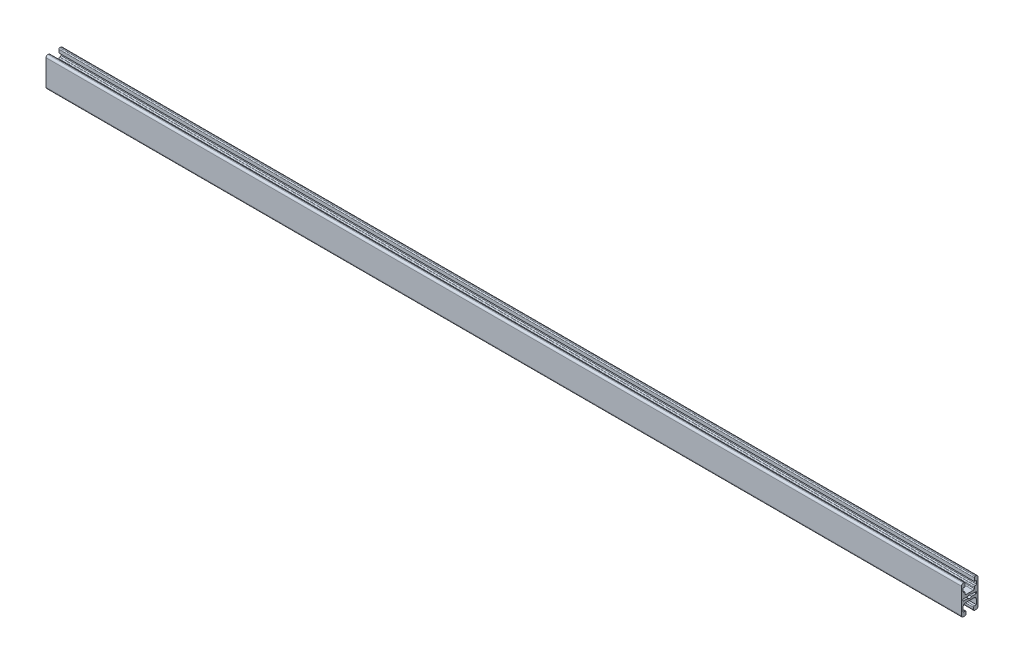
ISO-10303-21;
HEADER;
FILE_DESCRIPTION(('STEP AP214'),'2;1');
FILE_NAME('part.step','',(''),(''),'','','');
FILE_SCHEMA(('AUTOMOTIVE_DESIGN { 1 0 10303 214 1 1 1 1 }'));
ENDSEC;
DATA;
#1=APPLICATION_CONTEXT('core data for automotive mechanical design processes');
#2=APPLICATION_PROTOCOL_DEFINITION('international standard','automotive_design',2000,#1);
#3=PRODUCT_CONTEXT('',#1,'mechanical');
#4=PRODUCT('Part','Part','',(#3));
#5=PRODUCT_RELATED_PRODUCT_CATEGORY('part','',(#4));
#6=PRODUCT_DEFINITION_FORMATION('','',#4);
#7=PRODUCT_DEFINITION_CONTEXT('part definition',#1,'design');
#8=PRODUCT_DEFINITION('design','',#6,#7);
#9=PRODUCT_DEFINITION_SHAPE('','',#8);
#10=(LENGTH_UNIT() NAMED_UNIT(*) SI_UNIT(.MILLI.,.METRE.));
#11=(NAMED_UNIT(*) PLANE_ANGLE_UNIT() SI_UNIT($,.RADIAN.));
#12=(NAMED_UNIT(*) SI_UNIT($,.STERADIAN.) SOLID_ANGLE_UNIT());
#13=UNCERTAINTY_MEASURE_WITH_UNIT(LENGTH_MEASURE(1.E-05),#10,'distance_accuracy_value','');
#14=(GEOMETRIC_REPRESENTATION_CONTEXT(3) GLOBAL_UNCERTAINTY_ASSIGNED_CONTEXT((#13)) GLOBAL_UNIT_ASSIGNED_CONTEXT((#10,
#11,#12)) REPRESENTATION_CONTEXT('',''));
#15=CARTESIAN_POINT('',(0.,0.,0.));
#16=DIRECTION('',(0.,0.,1.));
#17=DIRECTION('',(1.,0.,0.));
#18=AXIS2_PLACEMENT_3D('',#15,#16,#17);
#19=CARTESIAN_POINT('',(1000.,14.,7.));
#20=DIRECTION('',(-1.,0.,0.));
#21=DIRECTION('',(0.,0.,1.));
#22=AXIS2_PLACEMENT_3D('',#19,#20,#21);
#23=CYLINDRICAL_SURFACE('',#22,2.);
#24=CARTESIAN_POINT('',(0.,14.,7.));
#25=DIRECTION('',(1.,0.,0.));
#26=DIRECTION('',(0.,0.,-1.));
#27=AXIS2_PLACEMENT_3D('',#24,#25,#26);
#28=CIRCLE('',#27,2.);
#29=CARTESIAN_POINT('',(0.,16.,7.));
#30=VERTEX_POINT('',#29);
#31=CARTESIAN_POINT('',(0.,14.,9.));
#32=VERTEX_POINT('',#31);
#33=EDGE_CURVE('E562',#30,#32,#28,.T.);
#34=ORIENTED_EDGE('',*,*,#33,.T.);
#35=DIRECTION('',(-1.,0.,0.));
#36=VECTOR('',#35,1.);
#37=CARTESIAN_POINT('',(1000.,14.,9.));
#38=LINE('',#37,#36);
#39=CARTESIAN_POINT('',(1000.,14.,9.));
#40=VERTEX_POINT('',#39);
#41=EDGE_CURVE('E13',#40,#32,#38,.T.);
#42=ORIENTED_EDGE('',*,*,#41,.F.);
#43=CARTESIAN_POINT('',(1000.,14.,7.));
#44=DIRECTION('',(1.,0.,0.));
#45=DIRECTION('',(0.,0.,-1.));
#46=AXIS2_PLACEMENT_3D('',#43,#44,#45);
#47=CIRCLE('',#46,2.);
#48=CARTESIAN_POINT('',(1000.,16.,7.));
#49=VERTEX_POINT('',#48);
#50=EDGE_CURVE('E850',#49,#40,#47,.T.);
#51=ORIENTED_EDGE('',*,*,#50,.F.);
#52=DIRECTION('',(-1.,0.,0.));
#53=VECTOR('',#52,1.);
#54=CARTESIAN_POINT('',(1000.,16.,7.));
#55=LINE('',#54,#53);
#56=EDGE_CURVE('E659',#49,#30,#55,.T.);
#57=ORIENTED_EDGE('',*,*,#56,.T.);
#58=EDGE_LOOP('',(#34,#42,#51,#57));
#59=FACE_BOUND('',#58,.T.);
#60=ADVANCED_FACE('F173',(#59),#23,.T.);
#61=CARTESIAN_POINT('',(1000.,-14.,9.));
#62=DIRECTION('',(0.,0.,-1.));
#63=DIRECTION('',(-1.,0.,0.));
#64=AXIS2_PLACEMENT_3D('',#61,#62,#63);
#65=PLANE('',#64);
#66=DIRECTION('',(0.,-1.,0.));
#67=VECTOR('',#66,1.);
#68=CARTESIAN_POINT('',(0.,-14.,9.));
#69=LINE('',#68,#67);
#70=CARTESIAN_POINT('',(0.,-14.,9.));
#71=VERTEX_POINT('',#70);
#72=EDGE_CURVE('E566',#32,#71,#69,.T.);
#73=ORIENTED_EDGE('',*,*,#72,.T.);
#74=DIRECTION('',(-1.,0.,0.));
#75=VECTOR('',#74,1.);
#76=CARTESIAN_POINT('',(1000.,-14.,9.));
#77=LINE('',#76,#75);
#78=CARTESIAN_POINT('',(1000.,-14.,9.));
#79=VERTEX_POINT('',#78);
#80=EDGE_CURVE('E184',#79,#71,#77,.T.);
#81=ORIENTED_EDGE('',*,*,#80,.F.);
#82=DIRECTION('',(0.,-1.,0.));
#83=VECTOR('',#82,1.);
#84=CARTESIAN_POINT('',(1000.,-14.,9.));
#85=LINE('',#84,#83);
#86=EDGE_CURVE('E852',#40,#79,#85,.T.);
#87=ORIENTED_EDGE('',*,*,#86,.F.);
#88=ORIENTED_EDGE('',*,*,#41,.T.);
#89=EDGE_LOOP('',(#73,#81,#87,#88));
#90=FACE_BOUND('',#89,.T.);
#91=ADVANCED_FACE('F955',(#90),#65,.F.);
#92=CARTESIAN_POINT('',(1000.,-14.,7.));
#93=DIRECTION('',(-1.,0.,0.));
#94=DIRECTION('',(0.,0.,1.));
#95=AXIS2_PLACEMENT_3D('',#92,#93,#94);
#96=CYLINDRICAL_SURFACE('',#95,2.);
#97=CARTESIAN_POINT('',(0.,-14.,7.));
#98=DIRECTION('',(1.,0.,0.));
#99=DIRECTION('',(0.,0.,-1.));
#100=AXIS2_PLACEMENT_3D('',#97,#98,#99);
#101=CIRCLE('',#100,2.);
#102=CARTESIAN_POINT('',(0.,-16.,7.));
#103=VERTEX_POINT('',#102);
#104=EDGE_CURVE('E569',#71,#103,#101,.T.);
#105=ORIENTED_EDGE('',*,*,#104,.T.);
#106=DIRECTION('',(-1.,0.,0.));
#107=VECTOR('',#106,1.);
#108=CARTESIAN_POINT('',(1000.,-16.,7.));
#109=LINE('',#108,#107);
#110=CARTESIAN_POINT('',(1000.,-16.,7.));
#111=VERTEX_POINT('',#110);
#112=EDGE_CURVE('E789',#111,#103,#109,.T.);
#113=ORIENTED_EDGE('',*,*,#112,.F.);
#114=CARTESIAN_POINT('',(1000.,-14.,7.));
#115=DIRECTION('',(1.,0.,0.));
#116=DIRECTION('',(0.,0.,-1.));
#117=AXIS2_PLACEMENT_3D('',#114,#115,#116);
#118=CIRCLE('',#117,2.);
#119=EDGE_CURVE('E854',#79,#111,#118,.T.);
#120=ORIENTED_EDGE('',*,*,#119,.F.);
#121=ORIENTED_EDGE('',*,*,#80,.T.);
#122=EDGE_LOOP('',(#105,#113,#120,#121));
#123=FACE_BOUND('',#122,.T.);
#124=ADVANCED_FACE('F960',(#123),#96,.T.);
#125=CARTESIAN_POINT('',(1000.,-16.,5.5));
#126=DIRECTION('',(0.,1.,0.));
#127=DIRECTION('',(0.,0.,1.));
#128=AXIS2_PLACEMENT_3D('',#125,#126,#127);
#129=PLANE('',#128);
#130=DIRECTION('',(0.,0.,-1.));
#131=VECTOR('',#130,1.);
#132=CARTESIAN_POINT('',(0.,-16.,5.5));
#133=LINE('',#132,#131);
#134=CARTESIAN_POINT('',(0.,-16.,5.5));
#135=VERTEX_POINT('',#134);
#136=EDGE_CURVE('E571',#103,#135,#133,.T.);
#137=ORIENTED_EDGE('',*,*,#136,.T.);
#138=DIRECTION('',(-1.,0.,0.));
#139=VECTOR('',#138,1.);
#140=CARTESIAN_POINT('',(1000.,-16.,5.5));
#141=LINE('',#140,#139);
#142=CARTESIAN_POINT('',(1000.,-16.,5.5));
#143=VERTEX_POINT('',#142);
#144=EDGE_CURVE('E786',#143,#135,#141,.T.);
#145=ORIENTED_EDGE('',*,*,#144,.F.);
#146=DIRECTION('',(0.,0.,-1.));
#147=VECTOR('',#146,1.);
#148=CARTESIAN_POINT('',(1000.,-16.,5.5));
#149=LINE('',#148,#147);
#150=EDGE_CURVE('E856',#111,#143,#149,.T.);
#151=ORIENTED_EDGE('',*,*,#150,.F.);
#152=ORIENTED_EDGE('',*,*,#112,.T.);
#153=EDGE_LOOP('',(#137,#145,#151,#152));
#154=FACE_BOUND('',#153,.T.);
#155=ADVANCED_FACE('F1126',(#154),#129,.F.);
#156=CARTESIAN_POINT('',(1000.,-14.5,5.50000000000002));
#157=DIRECTION('',(-1.,0.,0.));
#158=DIRECTION('',(0.,0.,1.));
#159=AXIS2_PLACEMENT_3D('',#156,#157,#158);
#160=CYLINDRICAL_SURFACE('',#159,1.50000000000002);
#161=CARTESIAN_POINT('',(0.,-14.5,5.50000000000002));
#162=DIRECTION('',(1.,0.,0.));
#163=DIRECTION('',(0.,0.,-1.));
#164=AXIS2_PLACEMENT_3D('',#161,#162,#163);
#165=CIRCLE('',#164,1.50000000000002);
#166=CARTESIAN_POINT('',(0.,-14.5,4.));
#167=VERTEX_POINT('',#166);
#168=EDGE_CURVE('E573',#135,#167,#165,.T.);
#169=ORIENTED_EDGE('',*,*,#168,.T.);
#170=DIRECTION('',(-1.,0.,0.));
#171=VECTOR('',#170,1.);
#172=CARTESIAN_POINT('',(1000.,-14.5,4.));
#173=LINE('',#172,#171);
#174=CARTESIAN_POINT('',(1000.,-14.5,4.));
#175=VERTEX_POINT('',#174);
#176=EDGE_CURVE('E783',#175,#167,#173,.T.);
#177=ORIENTED_EDGE('',*,*,#176,.F.);
#178=CARTESIAN_POINT('',(1000.,-14.5,5.50000000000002));
#179=DIRECTION('',(1.,0.,0.));
#180=DIRECTION('',(0.,0.,-1.));
#181=AXIS2_PLACEMENT_3D('',#178,#179,#180);
#182=CIRCLE('',#181,1.50000000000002);
#183=EDGE_CURVE('E858',#143,#175,#182,.T.);
#184=ORIENTED_EDGE('',*,*,#183,.F.);
#185=ORIENTED_EDGE('',*,*,#144,.T.);
#186=EDGE_LOOP('',(#169,#177,#184,#185));
#187=FACE_BOUND('',#186,.T.);
#188=ADVANCED_FACE('F1122',(#187),#160,.T.);
#189=CARTESIAN_POINT('',(1000.,-12.5,3.99999999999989));
#190=DIRECTION('',(0.,0.,1.));
#191=DIRECTION('',(0.,-1.,0.));
#192=AXIS2_PLACEMENT_3D('',#189,#190,#191);
#193=PLANE('',#192);
#194=DIRECTION('',(0.,1.,0.));
#195=VECTOR('',#194,1.);
#196=CARTESIAN_POINT('',(0.,-12.5,3.99999999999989));
#197=LINE('',#196,#195);
#198=CARTESIAN_POINT('',(0.,-12.5,3.99999999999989));
#199=VERTEX_POINT('',#198);
#200=EDGE_CURVE('E575',#167,#199,#197,.T.);
#201=ORIENTED_EDGE('',*,*,#200,.T.);
#202=DIRECTION('',(-1.,0.,0.));
#203=VECTOR('',#202,1.);
#204=CARTESIAN_POINT('',(1000.,-12.5,3.99999999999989));
#205=LINE('',#204,#203);
#206=CARTESIAN_POINT('',(1000.,-12.5,3.99999999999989));
#207=VERTEX_POINT('',#206);
#208=EDGE_CURVE('E780',#207,#199,#205,.T.);
#209=ORIENTED_EDGE('',*,*,#208,.F.);
#210=DIRECTION('',(0.,1.,0.));
#211=VECTOR('',#210,1.);
#212=CARTESIAN_POINT('',(1000.,-12.5,3.99999999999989));
#213=LINE('',#212,#211);
#214=EDGE_CURVE('E860',#175,#207,#213,.T.);
#215=ORIENTED_EDGE('',*,*,#214,.F.);
#216=ORIENTED_EDGE('',*,*,#176,.T.);
#217=EDGE_LOOP('',(#201,#209,#215,#216));
#218=FACE_BOUND('',#217,.T.);
#219=ADVANCED_FACE('F1118',(#218),#193,.F.);
#220=CARTESIAN_POINT('',(1000.,-12.5,4.99999999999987));
#221=DIRECTION('',(-1.,0.,0.));
#222=DIRECTION('',(0.,0.,1.));
#223=AXIS2_PLACEMENT_3D('',#220,#221,#222);
#224=CYLINDRICAL_SURFACE('',#223,0.999999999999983);
#225=CARTESIAN_POINT('',(0.,-12.5,4.99999999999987));
#226=DIRECTION('',(1.,0.,0.));
#227=DIRECTION('',(0.,0.,-1.));
#228=AXIS2_PLACEMENT_3D('',#225,#226,#227);
#229=CIRCLE('',#228,0.999999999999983);
#230=CARTESIAN_POINT('',(0.,-11.5,4.99999999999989));
#231=VERTEX_POINT('',#230);
#232=EDGE_CURVE('E577',#199,#231,#229,.T.);
#233=ORIENTED_EDGE('',*,*,#232,.T.);
#234=DIRECTION('',(-1.,0.,0.));
#235=VECTOR('',#234,1.);
#236=CARTESIAN_POINT('',(1000.,-11.5,4.99999999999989));
#237=LINE('',#236,#235);
#238=CARTESIAN_POINT('',(1000.,-11.5,4.99999999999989));
#239=VERTEX_POINT('',#238);
#240=EDGE_CURVE('E777',#239,#231,#237,.T.);
#241=ORIENTED_EDGE('',*,*,#240,.F.);
#242=CARTESIAN_POINT('',(1000.,-12.5,4.99999999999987));
#243=DIRECTION('',(1.,0.,0.));
#244=DIRECTION('',(0.,0.,-1.));
#245=AXIS2_PLACEMENT_3D('',#242,#243,#244);
#246=CIRCLE('',#245,0.999999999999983);
#247=EDGE_CURVE('E862',#207,#239,#246,.T.);
#248=ORIENTED_EDGE('',*,*,#247,.F.);
#249=ORIENTED_EDGE('',*,*,#208,.T.);
#250=EDGE_LOOP('',(#233,#241,#248,#249));
#251=FACE_BOUND('',#250,.T.);
#252=ADVANCED_FACE('F1114',(#251),#224,.T.);
#253=CARTESIAN_POINT('',(1000.,-11.5000000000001,7.17499999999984));
#254=DIRECTION('',(0.,-1.,0.));
#255=DIRECTION('',(0.,0.,-1.));
#256=AXIS2_PLACEMENT_3D('',#253,#254,#255);
#257=PLANE('',#256);
#258=DIRECTION('',(0.,0.,1.));
#259=VECTOR('',#258,1.);
#260=CARTESIAN_POINT('',(0.,-11.5000000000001,7.17499999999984));
#261=LINE('',#260,#259);
#262=CARTESIAN_POINT('',(0.,-11.5000000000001,7.17499999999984));
#263=VERTEX_POINT('',#262);
#264=EDGE_CURVE('E579',#231,#263,#261,.T.);
#265=ORIENTED_EDGE('',*,*,#264,.T.);
#266=DIRECTION('',(-1.,0.,0.));
#267=VECTOR('',#266,1.);
#268=CARTESIAN_POINT('',(1000.,-11.5000000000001,7.17499999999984));
#269=LINE('',#268,#267);
#270=CARTESIAN_POINT('',(1000.,-11.5000000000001,7.17499999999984));
#271=VERTEX_POINT('',#270);
#272=EDGE_CURVE('E774',#271,#263,#269,.T.);
#273=ORIENTED_EDGE('',*,*,#272,.F.);
#274=DIRECTION('',(0.,0.,1.));
#275=VECTOR('',#274,1.);
#276=CARTESIAN_POINT('',(1000.,-11.5000000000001,7.17499999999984));
#277=LINE('',#276,#275);
#278=EDGE_CURVE('E864',#239,#271,#277,.T.);
#279=ORIENTED_EDGE('',*,*,#278,.F.);
#280=ORIENTED_EDGE('',*,*,#240,.T.);
#281=EDGE_LOOP('',(#265,#273,#279,#280));
#282=FACE_BOUND('',#281,.T.);
#283=ADVANCED_FACE('F1110',(#282),#257,.F.);
#284=CARTESIAN_POINT('',(1000.,-6.24999999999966,7.17499999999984));
#285=DIRECTION('',(0.,0.,1.));
#286=DIRECTION('',(1.,0.,0.));
#287=AXIS2_PLACEMENT_3D('',#284,#285,#286);
#288=PLANE('',#287);
#289=DIRECTION('',(0.,1.,0.));
#290=VECTOR('',#289,1.);
#291=CARTESIAN_POINT('',(0.,-6.24999999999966,7.17499999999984));
#292=LINE('',#291,#290);
#293=CARTESIAN_POINT('',(0.,-6.24999999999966,7.17499999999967));
#294=VERTEX_POINT('',#293);
#295=EDGE_CURVE('E581',#263,#294,#292,.T.);
#296=ORIENTED_EDGE('',*,*,#295,.T.);
#297=DIRECTION('',(-1.,0.,0.));
#298=VECTOR('',#297,1.);
#299=CARTESIAN_POINT('',(1000.,-6.24999999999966,7.17499999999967));
#300=LINE('',#299,#298);
#301=CARTESIAN_POINT('',(1000.,-6.24999999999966,7.17499999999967));
#302=VERTEX_POINT('',#301);
#303=EDGE_CURVE('E771',#302,#294,#300,.T.);
#304=ORIENTED_EDGE('',*,*,#303,.F.);
#305=DIRECTION('',(0.,1.,0.));
#306=VECTOR('',#305,1.);
#307=CARTESIAN_POINT('',(1000.,-6.24999999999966,7.17499999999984));
#308=LINE('',#307,#306);
#309=EDGE_CURVE('E866',#271,#302,#308,.T.);
#310=ORIENTED_EDGE('',*,*,#309,.F.);
#311=ORIENTED_EDGE('',*,*,#272,.T.);
#312=EDGE_LOOP('',(#296,#304,#310,#311));
#313=FACE_BOUND('',#312,.T.);
#314=ADVANCED_FACE('F1106',(#313),#288,.F.);
#315=CARTESIAN_POINT('',(1000.,-6.24999999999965,4.67499999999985));
#316=DIRECTION('',(-1.,0.,0.));
#317=DIRECTION('',(0.,0.,1.));
#318=AXIS2_PLACEMENT_3D('',#315,#316,#317);
#319=CYLINDRICAL_SURFACE('',#318,2.49999999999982);
#320=CARTESIAN_POINT('',(0.,-6.24999999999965,4.67499999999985));
#321=DIRECTION('',(-1.,0.,0.));
#322=DIRECTION('',(0.,0.,-1.));
#323=AXIS2_PLACEMENT_3D('',#320,#321,#322);
#324=CIRCLE('',#323,2.49999999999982);
#325=CARTESIAN_POINT('',(0.,-3.75,4.67499999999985));
#326=VERTEX_POINT('',#325);
#327=EDGE_CURVE('E583',#294,#326,#324,.T.);
#328=ORIENTED_EDGE('',*,*,#327,.T.);
#329=DIRECTION('',(-1.,0.,0.));
#330=VECTOR('',#329,1.);
#331=CARTESIAN_POINT('',(1000.,-3.75,4.67499999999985));
#332=LINE('',#331,#330);
#333=CARTESIAN_POINT('',(1000.,-3.75,4.67499999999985));
#334=VERTEX_POINT('',#333);
#335=EDGE_CURVE('E768',#334,#326,#332,.T.);
#336=ORIENTED_EDGE('',*,*,#335,.F.);
#337=CARTESIAN_POINT('',(1000.,-6.24999999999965,4.67499999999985));
#338=DIRECTION('',(-1.,0.,0.));
#339=DIRECTION('',(0.,0.,-1.));
#340=AXIS2_PLACEMENT_3D('',#337,#338,#339);
#341=CIRCLE('',#340,2.49999999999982);
#342=EDGE_CURVE('E868',#302,#334,#341,.T.);
#343=ORIENTED_EDGE('',*,*,#342,.F.);
#344=ORIENTED_EDGE('',*,*,#303,.T.);
#345=EDGE_LOOP('',(#328,#336,#343,#344));
#346=FACE_BOUND('',#345,.T.);
#347=ADVANCED_FACE('F1102',(#346),#319,.F.);
#348=CARTESIAN_POINT('',(1000.,-3.75,-4.67499999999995));
#349=DIRECTION('',(0.,1.,0.));
#350=DIRECTION('',(0.,0.,1.));
#351=AXIS2_PLACEMENT_3D('',#348,#349,#350);
#352=PLANE('',#351);
#353=DIRECTION('',(0.,0.,-1.));
#354=VECTOR('',#353,1.);
#355=CARTESIAN_POINT('',(0.,-3.75,-4.67499999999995));
#356=LINE('',#355,#354);
#357=CARTESIAN_POINT('',(0.,-3.75,-4.67499999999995));
#358=VERTEX_POINT('',#357);
#359=EDGE_CURVE('E585',#326,#358,#356,.T.);
#360=ORIENTED_EDGE('',*,*,#359,.T.);
#361=DIRECTION('',(-1.,0.,0.));
#362=VECTOR('',#361,1.);
#363=CARTESIAN_POINT('',(1000.,-3.75,-4.67499999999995));
#364=LINE('',#363,#362);
#365=CARTESIAN_POINT('',(1000.,-3.75,-4.67499999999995));
#366=VERTEX_POINT('',#365);
#367=EDGE_CURVE('E764',#366,#358,#364,.T.);
#368=ORIENTED_EDGE('',*,*,#367,.F.);
#369=DIRECTION('',(0.,0.,-1.));
#370=VECTOR('',#369,1.);
#371=CARTESIAN_POINT('',(1000.,-3.75,-4.67499999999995));
#372=LINE('',#371,#370);
#373=EDGE_CURVE('E870',#334,#366,#372,.T.);
#374=ORIENTED_EDGE('',*,*,#373,.F.);
#375=ORIENTED_EDGE('',*,*,#335,.T.);
#376=EDGE_LOOP('',(#360,#368,#374,#375));
#377=FACE_BOUND('',#376,.T.);
#378=ADVANCED_FACE('F1098',(#377),#352,.F.);
#379=CARTESIAN_POINT('',(1000.,-6.25000000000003,-4.67499999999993));
#380=DIRECTION('',(-1.,0.,0.));
#381=DIRECTION('',(0.,0.,1.));
#382=AXIS2_PLACEMENT_3D('',#379,#380,#381);
#383=CYLINDRICAL_SURFACE('',#382,2.50000000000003);
#384=CARTESIAN_POINT('',(0.,-6.25000000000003,-4.67499999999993));
#385=DIRECTION('',(-1.,0.,0.));
#386=DIRECTION('',(0.,0.,-1.));
#387=AXIS2_PLACEMENT_3D('',#384,#385,#386);
#388=CIRCLE('',#387,2.50000000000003);
#389=CARTESIAN_POINT('',(0.,-6.25,-7.17499999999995));
#390=VERTEX_POINT('',#389);
#391=EDGE_CURVE('E587',#358,#390,#388,.T.);
#392=ORIENTED_EDGE('',*,*,#391,.T.);
#393=DIRECTION('',(-1.,0.,0.));
#394=VECTOR('',#393,1.);
#395=CARTESIAN_POINT('',(1000.,-6.25,-7.17499999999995));
#396=LINE('',#395,#394);
#397=CARTESIAN_POINT('',(1000.,-6.25,-7.17499999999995));
#398=VERTEX_POINT('',#397);
#399=EDGE_CURVE('E760',#398,#390,#396,.T.);
#400=ORIENTED_EDGE('',*,*,#399,.F.);
#401=CARTESIAN_POINT('',(1000.,-6.25000000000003,-4.67499999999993));
#402=DIRECTION('',(-1.,0.,0.));
#403=DIRECTION('',(0.,0.,-1.));
#404=AXIS2_PLACEMENT_3D('',#401,#402,#403);
#405=CIRCLE('',#404,2.50000000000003);
#406=EDGE_CURVE('E872',#366,#398,#405,.T.);
#407=ORIENTED_EDGE('',*,*,#406,.F.);
#408=ORIENTED_EDGE('',*,*,#367,.T.);
#409=EDGE_LOOP('',(#392,#400,#407,#408));
#410=FACE_BOUND('',#409,.T.);
#411=ADVANCED_FACE('F1094',(#410),#383,.F.);
#412=CARTESIAN_POINT('',(1000.,-11.5000000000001,-7.17500000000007));
#413=DIRECTION('',(0.,0.,-1.));
#414=DIRECTION('',(0.,1.,0.));
#415=AXIS2_PLACEMENT_3D('',#412,#413,#414);
#416=PLANE('',#415);
#417=DIRECTION('',(0.,-1.,0.));
#418=VECTOR('',#417,1.);
#419=CARTESIAN_POINT('',(0.,-11.5000000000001,-7.17500000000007));
#420=LINE('',#419,#418);
#421=CARTESIAN_POINT('',(0.,-11.5000000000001,-7.17500000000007));
#422=VERTEX_POINT('',#421);
#423=EDGE_CURVE('E589',#390,#422,#420,.T.);
#424=ORIENTED_EDGE('',*,*,#423,.T.);
#425=DIRECTION('',(-1.,0.,0.));
#426=VECTOR('',#425,1.);
#427=CARTESIAN_POINT('',(1000.,-11.5000000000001,-7.17500000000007));
#428=LINE('',#427,#426);
#429=CARTESIAN_POINT('',(1000.,-11.5000000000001,-7.17500000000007));
#430=VERTEX_POINT('',#429);
#431=EDGE_CURVE('E756',#430,#422,#428,.T.);
#432=ORIENTED_EDGE('',*,*,#431,.F.);
#433=DIRECTION('',(0.,-1.,0.));
#434=VECTOR('',#433,1.);
#435=CARTESIAN_POINT('',(1000.,-11.5000000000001,-7.17500000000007));
#436=LINE('',#435,#434);
#437=EDGE_CURVE('E874',#398,#430,#436,.T.);
#438=ORIENTED_EDGE('',*,*,#437,.F.);
#439=ORIENTED_EDGE('',*,*,#399,.T.);
#440=EDGE_LOOP('',(#424,#432,#438,#439));
#441=FACE_BOUND('',#440,.T.);
#442=ADVANCED_FACE('F1090',(#441),#416,.F.);
#443=CARTESIAN_POINT('',(1000.,-11.5,-4.99999999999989));
#444=DIRECTION('',(0.,-1.,0.));
#445=DIRECTION('',(0.,0.,-1.));
#446=AXIS2_PLACEMENT_3D('',#443,#444,#445);
#447=PLANE('',#446);
#448=DIRECTION('',(0.,0.,1.));
#449=VECTOR('',#448,1.);
#450=CARTESIAN_POINT('',(0.,-11.5,-4.99999999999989));
#451=LINE('',#450,#449);
#452=CARTESIAN_POINT('',(0.,-11.5,-4.99999999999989));
#453=VERTEX_POINT('',#452);
#454=EDGE_CURVE('E591',#422,#453,#451,.T.);
#455=ORIENTED_EDGE('',*,*,#454,.T.);
#456=DIRECTION('',(-1.,0.,0.));
#457=VECTOR('',#456,1.);
#458=CARTESIAN_POINT('',(1000.,-11.5,-4.99999999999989));
#459=LINE('',#458,#457);
#460=CARTESIAN_POINT('',(1000.,-11.5,-4.99999999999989));
#461=VERTEX_POINT('',#460);
#462=EDGE_CURVE('E753',#461,#453,#459,.T.);
#463=ORIENTED_EDGE('',*,*,#462,.F.);
#464=DIRECTION('',(0.,0.,1.));
#465=VECTOR('',#464,1.);
#466=CARTESIAN_POINT('',(1000.,-11.5,-4.99999999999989));
#467=LINE('',#466,#465);
#468=EDGE_CURVE('E876',#430,#461,#467,.T.);
#469=ORIENTED_EDGE('',*,*,#468,.F.);
#470=ORIENTED_EDGE('',*,*,#431,.T.);
#471=EDGE_LOOP('',(#455,#463,#469,#470));
#472=FACE_BOUND('',#471,.T.);
#473=ADVANCED_FACE('F1086',(#472),#447,.F.);
#474=CARTESIAN_POINT('',(1000.,-12.5,-4.99999999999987));
#475=DIRECTION('',(-1.,0.,0.));
#476=DIRECTION('',(0.,0.,1.));
#477=AXIS2_PLACEMENT_3D('',#474,#475,#476);
#478=CYLINDRICAL_SURFACE('',#477,0.999999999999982);
#479=CARTESIAN_POINT('',(0.,-12.5,-4.99999999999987));
#480=DIRECTION('',(1.,0.,0.));
#481=DIRECTION('',(0.,0.,-1.));
#482=AXIS2_PLACEMENT_3D('',#479,#480,#481);
#483=CIRCLE('',#482,0.999999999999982);
#484=CARTESIAN_POINT('',(0.,-12.5,-3.99999999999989));
#485=VERTEX_POINT('',#484);
#486=EDGE_CURVE('E593',#453,#485,#483,.T.);
#487=ORIENTED_EDGE('',*,*,#486,.T.);
#488=DIRECTION('',(-1.,0.,0.));
#489=VECTOR('',#488,1.);
#490=CARTESIAN_POINT('',(1000.,-12.5,-3.99999999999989));
#491=LINE('',#490,#489);
#492=CARTESIAN_POINT('',(1000.,-12.5,-3.99999999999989));
#493=VERTEX_POINT('',#492);
#494=EDGE_CURVE('E750',#493,#485,#491,.T.);
#495=ORIENTED_EDGE('',*,*,#494,.F.);
#496=CARTESIAN_POINT('',(1000.,-12.5,-4.99999999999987));
#497=DIRECTION('',(1.,0.,0.));
#498=DIRECTION('',(0.,0.,-1.));
#499=AXIS2_PLACEMENT_3D('',#496,#497,#498);
#500=CIRCLE('',#499,0.999999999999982);
#501=EDGE_CURVE('E878',#461,#493,#500,.T.);
#502=ORIENTED_EDGE('',*,*,#501,.F.);
#503=ORIENTED_EDGE('',*,*,#462,.T.);
#504=EDGE_LOOP('',(#487,#495,#502,#503));
#505=FACE_BOUND('',#504,.T.);
#506=ADVANCED_FACE('F1082',(#505),#478,.T.);
#507=CARTESIAN_POINT('',(1000.,-14.5,-4.));
#508=DIRECTION('',(0.,0.,-1.));
#509=DIRECTION('',(0.,1.,0.));
#510=AXIS2_PLACEMENT_3D('',#507,#508,#509);
#511=PLANE('',#510);
#512=DIRECTION('',(0.,-1.,0.));
#513=VECTOR('',#512,1.);
#514=CARTESIAN_POINT('',(0.,-14.5,-4.));
#515=LINE('',#514,#513);
#516=CARTESIAN_POINT('',(0.,-14.5,-4.));
#517=VERTEX_POINT('',#516);
#518=EDGE_CURVE('E595',#485,#517,#515,.T.);
#519=ORIENTED_EDGE('',*,*,#518,.T.);
#520=DIRECTION('',(-1.,0.,0.));
#521=VECTOR('',#520,1.);
#522=CARTESIAN_POINT('',(1000.,-14.5,-4.));
#523=LINE('',#522,#521);
#524=CARTESIAN_POINT('',(1000.,-14.5,-4.));
#525=VERTEX_POINT('',#524);
#526=EDGE_CURVE('E747',#525,#517,#523,.T.);
#527=ORIENTED_EDGE('',*,*,#526,.F.);
#528=DIRECTION('',(0.,-1.,0.));
#529=VECTOR('',#528,1.);
#530=CARTESIAN_POINT('',(1000.,-14.5,-4.));
#531=LINE('',#530,#529);
#532=EDGE_CURVE('E880',#493,#525,#531,.T.);
#533=ORIENTED_EDGE('',*,*,#532,.F.);
#534=ORIENTED_EDGE('',*,*,#494,.T.);
#535=EDGE_LOOP('',(#519,#527,#533,#534));
#536=FACE_BOUND('',#535,.T.);
#537=ADVANCED_FACE('F1078',(#536),#511,.F.);
#538=CARTESIAN_POINT('',(1000.,-14.5,-5.50000000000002));
#539=DIRECTION('',(-1.,0.,0.));
#540=DIRECTION('',(0.,0.,1.));
#541=AXIS2_PLACEMENT_3D('',#538,#539,#540);
#542=CYLINDRICAL_SURFACE('',#541,1.50000000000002);
#543=CARTESIAN_POINT('',(0.,-14.5,-5.50000000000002));
#544=DIRECTION('',(1.,0.,0.));
#545=DIRECTION('',(0.,0.,-1.));
#546=AXIS2_PLACEMENT_3D('',#543,#544,#545);
#547=CIRCLE('',#546,1.50000000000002);
#548=CARTESIAN_POINT('',(0.,-16.,-5.5));
#549=VERTEX_POINT('',#548);
#550=EDGE_CURVE('E597',#517,#549,#547,.T.);
#551=ORIENTED_EDGE('',*,*,#550,.T.);
#552=DIRECTION('',(-1.,0.,0.));
#553=VECTOR('',#552,1.);
#554=CARTESIAN_POINT('',(1000.,-16.,-5.5));
#555=LINE('',#554,#553);
#556=CARTESIAN_POINT('',(1000.,-16.,-5.5));
#557=VERTEX_POINT('',#556);
#558=EDGE_CURVE('E744',#557,#549,#555,.T.);
#559=ORIENTED_EDGE('',*,*,#558,.F.);
#560=CARTESIAN_POINT('',(1000.,-14.5,-5.50000000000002));
#561=DIRECTION('',(1.,0.,0.));
#562=DIRECTION('',(0.,0.,-1.));
#563=AXIS2_PLACEMENT_3D('',#560,#561,#562);
#564=CIRCLE('',#563,1.50000000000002);
#565=EDGE_CURVE('E882',#525,#557,#564,.T.);
#566=ORIENTED_EDGE('',*,*,#565,.F.);
#567=ORIENTED_EDGE('',*,*,#526,.T.);
#568=EDGE_LOOP('',(#551,#559,#566,#567));
#569=FACE_BOUND('',#568,.T.);
#570=ADVANCED_FACE('F1074',(#569),#542,.T.);
#571=CARTESIAN_POINT('',(1000.,-16.,-7.));
#572=DIRECTION('',(0.,1.,0.));
#573=DIRECTION('',(0.,0.,1.));
#574=AXIS2_PLACEMENT_3D('',#571,#572,#573);
#575=PLANE('',#574);
#576=DIRECTION('',(0.,0.,-1.));
#577=VECTOR('',#576,1.);
#578=CARTESIAN_POINT('',(0.,-16.,-7.));
#579=LINE('',#578,#577);
#580=CARTESIAN_POINT('',(0.,-16.,-7.));
#581=VERTEX_POINT('',#580);
#582=EDGE_CURVE('E599',#549,#581,#579,.T.);
#583=ORIENTED_EDGE('',*,*,#582,.T.);
#584=DIRECTION('',(-1.,0.,0.));
#585=VECTOR('',#584,1.);
#586=CARTESIAN_POINT('',(1000.,-16.,-7.));
#587=LINE('',#586,#585);
#588=CARTESIAN_POINT('',(1000.,-16.,-7.));
#589=VERTEX_POINT('',#588);
#590=EDGE_CURVE('E741',#589,#581,#587,.T.);
#591=ORIENTED_EDGE('',*,*,#590,.F.);
#592=DIRECTION('',(0.,0.,-1.));
#593=VECTOR('',#592,1.);
#594=CARTESIAN_POINT('',(1000.,-16.,-7.));
#595=LINE('',#594,#593);
#596=EDGE_CURVE('E884',#557,#589,#595,.T.);
#597=ORIENTED_EDGE('',*,*,#596,.F.);
#598=ORIENTED_EDGE('',*,*,#558,.T.);
#599=EDGE_LOOP('',(#583,#591,#597,#598));
#600=FACE_BOUND('',#599,.T.);
#601=ADVANCED_FACE('F1070',(#600),#575,.F.);
#602=CARTESIAN_POINT('',(1000.,-14.,-7.));
#603=DIRECTION('',(-1.,0.,0.));
#604=DIRECTION('',(0.,0.,1.));
#605=AXIS2_PLACEMENT_3D('',#602,#603,#604);
#606=CYLINDRICAL_SURFACE('',#605,2.);
#607=CARTESIAN_POINT('',(0.,-14.,-7.));
#608=DIRECTION('',(1.,0.,0.));
#609=DIRECTION('',(0.,0.,-1.));
#610=AXIS2_PLACEMENT_3D('',#607,#608,#609);
#611=CIRCLE('',#610,2.);
#612=CARTESIAN_POINT('',(0.,-14.,-9.));
#613=VERTEX_POINT('',#612);
#614=EDGE_CURVE('E601',#581,#613,#611,.T.);
#615=ORIENTED_EDGE('',*,*,#614,.T.);
#616=DIRECTION('',(-1.,0.,0.));
#617=VECTOR('',#616,1.);
#618=CARTESIAN_POINT('',(1000.,-14.,-9.));
#619=LINE('',#618,#617);
#620=CARTESIAN_POINT('',(1000.,-14.,-9.));
#621=VERTEX_POINT('',#620);
#622=EDGE_CURVE('E737',#621,#613,#619,.T.);
#623=ORIENTED_EDGE('',*,*,#622,.F.);
#624=CARTESIAN_POINT('',(1000.,-14.,-7.));
#625=DIRECTION('',(1.,0.,0.));
#626=DIRECTION('',(0.,0.,-1.));
#627=AXIS2_PLACEMENT_3D('',#624,#625,#626);
#628=CIRCLE('',#627,2.);
#629=EDGE_CURVE('E886',#589,#621,#628,.T.);
#630=ORIENTED_EDGE('',*,*,#629,.F.);
#631=ORIENTED_EDGE('',*,*,#590,.T.);
#632=EDGE_LOOP('',(#615,#623,#630,#631));
#633=FACE_BOUND('',#632,.T.);
#634=ADVANCED_FACE('F1066',(#633),#606,.T.);
#635=CARTESIAN_POINT('',(1000.,14.,-9.));
#636=DIRECTION('',(0.,0.,1.));
#637=DIRECTION('',(1.,0.,0.));
#638=AXIS2_PLACEMENT_3D('',#635,#636,#637);
#639=PLANE('',#638);
#640=DIRECTION('',(0.,1.,0.));
#641=VECTOR('',#640,1.);
#642=CARTESIAN_POINT('',(0.,14.,-9.));
#643=LINE('',#642,#641);
#644=CARTESIAN_POINT('',(0.,14.,-9.));
#645=VERTEX_POINT('',#644);
#646=EDGE_CURVE('E603',#613,#645,#643,.T.);
#647=ORIENTED_EDGE('',*,*,#646,.T.);
#648=DIRECTION('',(-1.,0.,0.));
#649=VECTOR('',#648,1.);
#650=CARTESIAN_POINT('',(1000.,14.,-9.));
#651=LINE('',#650,#649);
#652=CARTESIAN_POINT('',(1000.,14.,-9.));
#653=VERTEX_POINT('',#652);
#654=EDGE_CURVE('E734',#653,#645,#651,.T.);
#655=ORIENTED_EDGE('',*,*,#654,.F.);
#656=DIRECTION('',(0.,1.,0.));
#657=VECTOR('',#656,1.);
#658=CARTESIAN_POINT('',(1000.,14.,-9.));
#659=LINE('',#658,#657);
#660=EDGE_CURVE('E888',#621,#653,#659,.T.);
#661=ORIENTED_EDGE('',*,*,#660,.F.);
#662=ORIENTED_EDGE('',*,*,#622,.T.);
#663=EDGE_LOOP('',(#647,#655,#661,#662));
#664=FACE_BOUND('',#663,.T.);
#665=ADVANCED_FACE('F1062',(#664),#639,.F.);
#666=CARTESIAN_POINT('',(1000.,14.,-7.));
#667=DIRECTION('',(-1.,0.,0.));
#668=DIRECTION('',(0.,0.,1.));
#669=AXIS2_PLACEMENT_3D('',#666,#667,#668);
#670=CYLINDRICAL_SURFACE('',#669,2.);
#671=CARTESIAN_POINT('',(0.,14.,-7.));
#672=DIRECTION('',(1.,0.,0.));
#673=DIRECTION('',(0.,0.,-1.));
#674=AXIS2_PLACEMENT_3D('',#671,#672,#673);
#675=CIRCLE('',#674,2.);
#676=CARTESIAN_POINT('',(0.,16.,-7.));
#677=VERTEX_POINT('',#676);
#678=EDGE_CURVE('E605',#645,#677,#675,.T.);
#679=ORIENTED_EDGE('',*,*,#678,.T.);
#680=DIRECTION('',(-1.,0.,0.));
#681=VECTOR('',#680,1.);
#682=CARTESIAN_POINT('',(1000.,16.,-7.));
#683=LINE('',#682,#681);
#684=CARTESIAN_POINT('',(1000.,16.,-7.));
#685=VERTEX_POINT('',#684);
#686=EDGE_CURVE('E731',#685,#677,#683,.T.);
#687=ORIENTED_EDGE('',*,*,#686,.F.);
#688=CARTESIAN_POINT('',(1000.,14.,-7.));
#689=DIRECTION('',(1.,0.,0.));
#690=DIRECTION('',(0.,0.,-1.));
#691=AXIS2_PLACEMENT_3D('',#688,#689,#690);
#692=CIRCLE('',#691,2.);
#693=EDGE_CURVE('E890',#653,#685,#692,.T.);
#694=ORIENTED_EDGE('',*,*,#693,.F.);
#695=ORIENTED_EDGE('',*,*,#654,.T.);
#696=EDGE_LOOP('',(#679,#687,#694,#695));
#697=FACE_BOUND('',#696,.T.);
#698=ADVANCED_FACE('F1058',(#697),#670,.T.);
#699=CARTESIAN_POINT('',(1000.,16.,-6.));
#700=DIRECTION('',(0.,-1.,0.));
#701=DIRECTION('',(0.,0.,-1.));
#702=AXIS2_PLACEMENT_3D('',#699,#700,#701);
#703=PLANE('',#702);
#704=DIRECTION('',(0.,0.,1.));
#705=VECTOR('',#704,1.);
#706=CARTESIAN_POINT('',(0.,16.,-6.));
#707=LINE('',#706,#705);
#708=CARTESIAN_POINT('',(0.,16.,-6.));
#709=VERTEX_POINT('',#708);
#710=EDGE_CURVE('E607',#677,#709,#707,.T.);
#711=ORIENTED_EDGE('',*,*,#710,.T.);
#712=DIRECTION('',(-1.,0.,0.));
#713=VECTOR('',#712,1.);
#714=CARTESIAN_POINT('',(1000.,16.,-6.));
#715=LINE('',#714,#713);
#716=CARTESIAN_POINT('',(1000.,16.,-6.));
#717=VERTEX_POINT('',#716);
#718=EDGE_CURVE('E728',#717,#709,#715,.T.);
#719=ORIENTED_EDGE('',*,*,#718,.F.);
#720=DIRECTION('',(0.,0.,1.));
#721=VECTOR('',#720,1.);
#722=CARTESIAN_POINT('',(1000.,16.,-6.));
#723=LINE('',#722,#721);
#724=EDGE_CURVE('E892',#685,#717,#723,.T.);
#725=ORIENTED_EDGE('',*,*,#724,.F.);
#726=ORIENTED_EDGE('',*,*,#686,.T.);
#727=EDGE_LOOP('',(#711,#719,#725,#726));
#728=FACE_BOUND('',#727,.T.);
#729=ADVANCED_FACE('F1054',(#728),#703,.F.);
#730=CARTESIAN_POINT('',(1000.,15.,-6.));
#731=DIRECTION('',(-1.,0.,0.));
#732=DIRECTION('',(0.,0.,1.));
#733=AXIS2_PLACEMENT_3D('',#730,#731,#732);
#734=CYLINDRICAL_SURFACE('',#733,1.);
#735=CARTESIAN_POINT('',(0.,15.,-6.));
#736=DIRECTION('',(1.,0.,0.));
#737=DIRECTION('',(0.,0.,-1.));
#738=AXIS2_PLACEMENT_3D('',#735,#736,#737);
#739=CIRCLE('',#738,1.);
#740=CARTESIAN_POINT('',(0.,15.,-5.));
#741=VERTEX_POINT('',#740);
#742=EDGE_CURVE('E609',#709,#741,#739,.T.);
#743=ORIENTED_EDGE('',*,*,#742,.T.);
#744=DIRECTION('',(-1.,0.,0.));
#745=VECTOR('',#744,1.);
#746=CARTESIAN_POINT('',(1000.,15.,-5.));
#747=LINE('',#746,#745);
#748=CARTESIAN_POINT('',(1000.,15.,-5.));
#749=VERTEX_POINT('',#748);
#750=EDGE_CURVE('E725',#749,#741,#747,.T.);
#751=ORIENTED_EDGE('',*,*,#750,.F.);
#752=CARTESIAN_POINT('',(1000.,15.,-6.));
#753=DIRECTION('',(1.,0.,0.));
#754=DIRECTION('',(0.,0.,-1.));
#755=AXIS2_PLACEMENT_3D('',#752,#753,#754);
#756=CIRCLE('',#755,1.);
#757=EDGE_CURVE('E894',#717,#749,#756,.T.);
#758=ORIENTED_EDGE('',*,*,#757,.F.);
#759=ORIENTED_EDGE('',*,*,#718,.T.);
#760=EDGE_LOOP('',(#743,#751,#758,#759));
#761=FACE_BOUND('',#760,.T.);
#762=ADVANCED_FACE('F1050',(#761),#734,.T.);
#763=CARTESIAN_POINT('',(1000.,11.5,-5.));
#764=DIRECTION('',(0.,0.,-1.));
#765=DIRECTION('',(-1.,0.,0.));
#766=AXIS2_PLACEMENT_3D('',#763,#764,#765);
#767=PLANE('',#766);
#768=DIRECTION('',(0.,-1.,0.));
#769=VECTOR('',#768,1.);
#770=CARTESIAN_POINT('',(0.,11.5,-5.));
#771=LINE('',#770,#769);
#772=CARTESIAN_POINT('',(0.,11.5,-5.));
#773=VERTEX_POINT('',#772);
#774=EDGE_CURVE('E611',#741,#773,#771,.T.);
#775=ORIENTED_EDGE('',*,*,#774,.T.);
#776=DIRECTION('',(-1.,0.,0.));
#777=VECTOR('',#776,1.);
#778=CARTESIAN_POINT('',(1000.,11.5,-5.));
#779=LINE('',#778,#777);
#780=CARTESIAN_POINT('',(1000.,11.5,-5.));
#781=VERTEX_POINT('',#780);
#782=EDGE_CURVE('E721',#781,#773,#779,.T.);
#783=ORIENTED_EDGE('',*,*,#782,.F.);
#784=DIRECTION('',(0.,-1.,0.));
#785=VECTOR('',#784,1.);
#786=CARTESIAN_POINT('',(1000.,11.5,-5.));
#787=LINE('',#786,#785);
#788=EDGE_CURVE('E896',#749,#781,#787,.T.);
#789=ORIENTED_EDGE('',*,*,#788,.F.);
#790=ORIENTED_EDGE('',*,*,#750,.T.);
#791=EDGE_LOOP('',(#775,#783,#789,#790));
#792=FACE_BOUND('',#791,.T.);
#793=ADVANCED_FACE('F1046',(#792),#767,.F.);
#794=CARTESIAN_POINT('',(1000.,11.4999999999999,-7.17500000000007));
#795=DIRECTION('',(0.,1.,0.));
#796=DIRECTION('',(0.,0.,1.));
#797=AXIS2_PLACEMENT_3D('',#794,#795,#796);
#798=PLANE('',#797);
#799=DIRECTION('',(0.,0.,-1.));
#800=VECTOR('',#799,1.);
#801=CARTESIAN_POINT('',(0.,11.4999999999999,-7.17500000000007));
#802=LINE('',#801,#800);
#803=CARTESIAN_POINT('',(0.,11.4999999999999,-7.17500000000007));
#804=VERTEX_POINT('',#803);
#805=EDGE_CURVE('E614',#773,#804,#802,.T.);
#806=ORIENTED_EDGE('',*,*,#805,.T.);
#807=DIRECTION('',(-1.,0.,0.));
#808=VECTOR('',#807,1.);
#809=CARTESIAN_POINT('',(1000.,11.4999999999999,-7.17500000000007));
#810=LINE('',#809,#808);
#811=CARTESIAN_POINT('',(1000.,11.4999999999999,-7.17500000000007));
#812=VERTEX_POINT('',#811);
#813=EDGE_CURVE('E718',#812,#804,#810,.T.);
#814=ORIENTED_EDGE('',*,*,#813,.F.);
#815=DIRECTION('',(0.,0.,-1.));
#816=VECTOR('',#815,1.);
#817=CARTESIAN_POINT('',(1000.,11.4999999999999,-7.17500000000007));
#818=LINE('',#817,#816);
#819=EDGE_CURVE('E898',#781,#812,#818,.T.);
#820=ORIENTED_EDGE('',*,*,#819,.F.);
#821=ORIENTED_EDGE('',*,*,#782,.T.);
#822=EDGE_LOOP('',(#806,#814,#820,#821));
#823=FACE_BOUND('',#822,.T.);
#824=ADVANCED_FACE('F1042',(#823),#798,.F.);
#825=CARTESIAN_POINT('',(1000.,8.,-7.17499999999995));
#826=DIRECTION('',(0.,0.,-1.));
#827=DIRECTION('',(0.,1.,0.));
#828=AXIS2_PLACEMENT_3D('',#825,#826,#827);
#829=PLANE('',#828);
#830=DIRECTION('',(0.,-1.,0.));
#831=VECTOR('',#830,1.);
#832=CARTESIAN_POINT('',(0.,8.,-7.17499999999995));
#833=LINE('',#832,#831);
#834=CARTESIAN_POINT('',(0.,8.,-7.17499999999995));
#835=VERTEX_POINT('',#834);
#836=EDGE_CURVE('E617',#804,#835,#833,.T.);
#837=ORIENTED_EDGE('',*,*,#836,.T.);
#838=DIRECTION('',(-1.,0.,0.));
#839=VECTOR('',#838,1.);
#840=CARTESIAN_POINT('',(1000.,8.,-7.17499999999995));
#841=LINE('',#840,#839);
#842=CARTESIAN_POINT('',(1000.,8.,-7.17499999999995));
#843=VERTEX_POINT('',#842);
#844=EDGE_CURVE('E714',#843,#835,#841,.T.);
#845=ORIENTED_EDGE('',*,*,#844,.F.);
#846=DIRECTION('',(0.,-1.,0.));
#847=VECTOR('',#846,1.);
#848=CARTESIAN_POINT('',(1000.,8.,-7.17499999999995));
#849=LINE('',#848,#847);
#850=EDGE_CURVE('E900',#812,#843,#849,.T.);
#851=ORIENTED_EDGE('',*,*,#850,.F.);
#852=ORIENTED_EDGE('',*,*,#813,.T.);
#853=EDGE_LOOP('',(#837,#845,#851,#852));
#854=FACE_BOUND('',#853,.T.);
#855=ADVANCED_FACE('F1038',(#854),#829,.F.);
#856=CARTESIAN_POINT('',(1000.,8.00000000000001,-6.17499999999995));
#857=DIRECTION('',(-1.,0.,0.));
#858=DIRECTION('',(0.,0.,1.));
#859=AXIS2_PLACEMENT_3D('',#856,#857,#858);
#860=CYLINDRICAL_SURFACE('',#859,1.00000000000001);
#861=CARTESIAN_POINT('',(0.,8.00000000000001,-6.17499999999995));
#862=DIRECTION('',(-1.,0.,0.));
#863=DIRECTION('',(0.,0.,-1.));
#864=AXIS2_PLACEMENT_3D('',#861,#862,#863);
#865=CIRCLE('',#864,1.00000000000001);
#866=CARTESIAN_POINT('',(0.,7.,-6.17499999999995));
#867=VERTEX_POINT('',#866);
#868=EDGE_CURVE('E620',#835,#867,#865,.T.);
#869=ORIENTED_EDGE('',*,*,#868,.T.);
#870=DIRECTION('',(-1.,0.,0.));
#871=VECTOR('',#870,1.);
#872=CARTESIAN_POINT('',(1000.,7.,-6.17499999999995));
#873=LINE('',#872,#871);
#874=CARTESIAN_POINT('',(1000.,7.,-6.17499999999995));
#875=VERTEX_POINT('',#874);
#876=EDGE_CURVE('E710',#875,#867,#873,.T.);
#877=ORIENTED_EDGE('',*,*,#876,.F.);
#878=CARTESIAN_POINT('',(1000.,8.00000000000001,-6.17499999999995));
#879=DIRECTION('',(-1.,0.,0.));
#880=DIRECTION('',(0.,0.,-1.));
#881=AXIS2_PLACEMENT_3D('',#878,#879,#880);
#882=CIRCLE('',#881,1.00000000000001);
#883=EDGE_CURVE('E902',#843,#875,#882,.T.);
#884=ORIENTED_EDGE('',*,*,#883,.F.);
#885=ORIENTED_EDGE('',*,*,#844,.T.);
#886=EDGE_LOOP('',(#869,#877,#884,#885));
#887=FACE_BOUND('',#886,.T.);
#888=ADVANCED_FACE('F1034',(#887),#860,.F.);
#889=CARTESIAN_POINT('',(1000.,7.,-5.99999999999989));
#890=DIRECTION('',(0.,-1.,0.));
#891=DIRECTION('',(0.,0.,-1.));
#892=AXIS2_PLACEMENT_3D('',#889,#890,#891);
#893=PLANE('',#892);
#894=DIRECTION('',(0.,0.,1.));
#895=VECTOR('',#894,1.);
#896=CARTESIAN_POINT('',(0.,7.,-5.99999999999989));
#897=LINE('',#896,#895);
#898=CARTESIAN_POINT('',(0.,7.,-5.99999999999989));
#899=VERTEX_POINT('',#898);
#900=EDGE_CURVE('E623',#867,#899,#897,.T.);
#901=ORIENTED_EDGE('',*,*,#900,.T.);
#902=DIRECTION('',(-1.,0.,0.));
#903=VECTOR('',#902,1.);
#904=CARTESIAN_POINT('',(1000.,7.,-5.99999999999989));
#905=LINE('',#904,#903);
#906=CARTESIAN_POINT('',(1000.,7.,-5.99999999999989));
#907=VERTEX_POINT('',#906);
#908=EDGE_CURVE('E706',#907,#899,#905,.T.);
#909=ORIENTED_EDGE('',*,*,#908,.F.);
#910=DIRECTION('',(0.,0.,1.));
#911=VECTOR('',#910,1.);
#912=CARTESIAN_POINT('',(1000.,7.,-5.99999999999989));
#913=LINE('',#912,#911);
#914=EDGE_CURVE('E904',#875,#907,#913,.T.);
#915=ORIENTED_EDGE('',*,*,#914,.F.);
#916=ORIENTED_EDGE('',*,*,#876,.T.);
#917=EDGE_LOOP('',(#901,#909,#915,#916));
#918=FACE_BOUND('',#917,.T.);
#919=ADVANCED_FACE('F1030',(#918),#893,.F.);
#920=CARTESIAN_POINT('',(1000.,6.,-5.99999999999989));
#921=DIRECTION('',(-1.,0.,0.));
#922=DIRECTION('',(0.,0.,1.));
#923=AXIS2_PLACEMENT_3D('',#920,#921,#922);
#924=CYLINDRICAL_SURFACE('',#923,1.);
#925=CARTESIAN_POINT('',(0.,6.,-5.99999999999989));
#926=DIRECTION('',(1.,0.,0.));
#927=DIRECTION('',(0.,0.,-1.));
#928=AXIS2_PLACEMENT_3D('',#925,#926,#927);
#929=CIRCLE('',#928,1.);
#930=CARTESIAN_POINT('',(0.,6.,-4.99999999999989));
#931=VERTEX_POINT('',#930);
#932=EDGE_CURVE('E626',#899,#931,#929,.T.);
#933=ORIENTED_EDGE('',*,*,#932,.T.);
#934=DIRECTION('',(-1.,0.,0.));
#935=VECTOR('',#934,1.);
#936=CARTESIAN_POINT('',(1000.,6.,-4.99999999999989));
#937=LINE('',#936,#935);
#938=CARTESIAN_POINT('',(1000.,6.,-4.99999999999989));
#939=VERTEX_POINT('',#938);
#940=EDGE_CURVE('E702',#939,#931,#937,.T.);
#941=ORIENTED_EDGE('',*,*,#940,.F.);
#942=CARTESIAN_POINT('',(1000.,6.,-5.99999999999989));
#943=DIRECTION('',(1.,0.,0.));
#944=DIRECTION('',(0.,0.,-1.));
#945=AXIS2_PLACEMENT_3D('',#942,#943,#944);
#946=CIRCLE('',#945,1.);
#947=EDGE_CURVE('E906',#907,#939,#946,.T.);
#948=ORIENTED_EDGE('',*,*,#947,.F.);
#949=ORIENTED_EDGE('',*,*,#908,.T.);
#950=EDGE_LOOP('',(#933,#941,#948,#949));
#951=FACE_BOUND('',#950,.T.);
#952=ADVANCED_FACE('F1026',(#951),#924,.T.);
#953=CARTESIAN_POINT('',(1000.,4.74999999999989,-4.99999999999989));
#954=DIRECTION('',(0.,0.,-1.));
#955=DIRECTION('',(-1.,0.,0.));
#956=AXIS2_PLACEMENT_3D('',#953,#954,#955);
#957=PLANE('',#956);
#958=DIRECTION('',(0.,-1.,0.));
#959=VECTOR('',#958,1.);
#960=CARTESIAN_POINT('',(0.,4.74999999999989,-4.99999999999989));
#961=LINE('',#960,#959);
#962=CARTESIAN_POINT('',(0.,4.74999999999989,-4.99999999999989));
#963=VERTEX_POINT('',#962);
#964=EDGE_CURVE('E629',#931,#963,#961,.T.);
#965=ORIENTED_EDGE('',*,*,#964,.T.);
#966=DIRECTION('',(-1.,0.,0.));
#967=VECTOR('',#966,1.);
#968=CARTESIAN_POINT('',(1000.,4.74999999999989,-4.99999999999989));
#969=LINE('',#968,#967);
#970=CARTESIAN_POINT('',(1000.,4.74999999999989,-4.99999999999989));
#971=VERTEX_POINT('',#970);
#972=EDGE_CURVE('E698',#971,#963,#969,.T.);
#973=ORIENTED_EDGE('',*,*,#972,.F.);
#974=DIRECTION('',(0.,-1.,0.));
#975=VECTOR('',#974,1.);
#976=CARTESIAN_POINT('',(1000.,4.74999999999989,-4.99999999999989));
#977=LINE('',#976,#975);
#978=EDGE_CURVE('E908',#939,#971,#977,.T.);
#979=ORIENTED_EDGE('',*,*,#978,.F.);
#980=ORIENTED_EDGE('',*,*,#940,.T.);
#981=EDGE_LOOP('',(#965,#973,#979,#980));
#982=FACE_BOUND('',#981,.T.);
#983=ADVANCED_FACE('F1022',(#982),#957,.F.);
#984=CARTESIAN_POINT('',(1000.,4.74999999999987,-3.9999999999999));
#985=DIRECTION('',(-1.,0.,0.));
#986=DIRECTION('',(0.,0.,1.));
#987=AXIS2_PLACEMENT_3D('',#984,#985,#986);
#988=CYLINDRICAL_SURFACE('',#987,0.999999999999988);
#989=CARTESIAN_POINT('',(0.,4.74999999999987,-3.9999999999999));
#990=DIRECTION('',(-1.,0.,0.));
#991=DIRECTION('',(0.,0.,-1.));
#992=AXIS2_PLACEMENT_3D('',#989,#990,#991);
#993=CIRCLE('',#992,0.999999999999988);
#994=CARTESIAN_POINT('',(0.,3.74999999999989,-3.99999999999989));
#995=VERTEX_POINT('',#994);
#996=EDGE_CURVE('E632',#963,#995,#993,.T.);
#997=ORIENTED_EDGE('',*,*,#996,.T.);
#998=DIRECTION('',(-1.,0.,0.));
#999=VECTOR('',#998,1.);
#1000=CARTESIAN_POINT('',(1000.,3.74999999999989,-3.99999999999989));
#1001=LINE('',#1000,#999);
#1002=CARTESIAN_POINT('',(1000.,3.74999999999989,-3.99999999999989));
#1003=VERTEX_POINT('',#1002);
#1004=EDGE_CURVE('E694',#1003,#995,#1001,.T.);
#1005=ORIENTED_EDGE('',*,*,#1004,.F.);
#1006=CARTESIAN_POINT('',(1000.,4.74999999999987,-3.9999999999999));
#1007=DIRECTION('',(-1.,0.,0.));
#1008=DIRECTION('',(0.,0.,-1.));
#1009=AXIS2_PLACEMENT_3D('',#1006,#1007,#1008);
#1010=CIRCLE('',#1009,0.999999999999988);
#1011=EDGE_CURVE('E910',#971,#1003,#1010,.T.);
#1012=ORIENTED_EDGE('',*,*,#1011,.F.);
#1013=ORIENTED_EDGE('',*,*,#972,.T.);
#1014=EDGE_LOOP('',(#997,#1005,#1012,#1013));
#1015=FACE_BOUND('',#1014,.T.);
#1016=ADVANCED_FACE('F1018',(#1015),#988,.F.);
#1017=CARTESIAN_POINT('',(1000.,3.75000000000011,4.00000000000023));
#1018=DIRECTION('',(0.,-1.,0.));
#1019=DIRECTION('',(0.,0.,-1.));
#1020=AXIS2_PLACEMENT_3D('',#1017,#1018,#1019);
#1021=PLANE('',#1020);
#1022=DIRECTION('',(0.,0.,1.));
#1023=VECTOR('',#1022,1.);
#1024=CARTESIAN_POINT('',(0.,3.75000000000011,4.00000000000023));
#1025=LINE('',#1024,#1023);
#1026=CARTESIAN_POINT('',(0.,3.75000000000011,4.00000000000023));
#1027=VERTEX_POINT('',#1026);
#1028=EDGE_CURVE('E634',#995,#1027,#1025,.T.);
#1029=ORIENTED_EDGE('',*,*,#1028,.T.);
#1030=DIRECTION('',(-1.,0.,0.));
#1031=VECTOR('',#1030,1.);
#1032=CARTESIAN_POINT('',(1000.,3.75000000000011,4.00000000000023));
#1033=LINE('',#1032,#1031);
#1034=CARTESIAN_POINT('',(1000.,3.75000000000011,4.00000000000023));
#1035=VERTEX_POINT('',#1034);
#1036=EDGE_CURVE('E690',#1035,#1027,#1033,.T.);
#1037=ORIENTED_EDGE('',*,*,#1036,.F.);
#1038=DIRECTION('',(0.,0.,1.));
#1039=VECTOR('',#1038,1.);
#1040=CARTESIAN_POINT('',(1000.,3.75000000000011,4.00000000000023));
#1041=LINE('',#1040,#1039);
#1042=EDGE_CURVE('E912',#1003,#1035,#1041,.T.);
#1043=ORIENTED_EDGE('',*,*,#1042,.F.);
#1044=ORIENTED_EDGE('',*,*,#1004,.T.);
#1045=EDGE_LOOP('',(#1029,#1037,#1043,#1044));
#1046=FACE_BOUND('',#1045,.T.);
#1047=ADVANCED_FACE('F1014',(#1046),#1021,.F.);
#1048=CARTESIAN_POINT('',(1000.,4.75000000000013,4.00000000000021));
#1049=DIRECTION('',(-1.,0.,0.));
#1050=DIRECTION('',(0.,0.,1.));
#1051=AXIS2_PLACEMENT_3D('',#1048,#1049,#1050);
#1052=CYLINDRICAL_SURFACE('',#1051,1.00000000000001);
#1053=CARTESIAN_POINT('',(0.,4.75000000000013,4.00000000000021));
#1054=DIRECTION('',(-1.,0.,0.));
#1055=DIRECTION('',(0.,0.,-1.));
#1056=AXIS2_PLACEMENT_3D('',#1053,#1054,#1055);
#1057=CIRCLE('',#1056,1.00000000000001);
#1058=CARTESIAN_POINT('',(0.,4.75000000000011,5.00000000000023));
#1059=VERTEX_POINT('',#1058);
#1060=EDGE_CURVE('E636',#1027,#1059,#1057,.T.);
#1061=ORIENTED_EDGE('',*,*,#1060,.T.);
#1062=DIRECTION('',(-1.,0.,0.));
#1063=VECTOR('',#1062,1.);
#1064=CARTESIAN_POINT('',(1000.,4.75000000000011,5.00000000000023));
#1065=LINE('',#1064,#1063);
#1066=CARTESIAN_POINT('',(1000.,4.75000000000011,5.00000000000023));
#1067=VERTEX_POINT('',#1066);
#1068=EDGE_CURVE('E686',#1067,#1059,#1065,.T.);
#1069=ORIENTED_EDGE('',*,*,#1068,.F.);
#1070=CARTESIAN_POINT('',(1000.,4.75000000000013,4.00000000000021));
#1071=DIRECTION('',(-1.,0.,0.));
#1072=DIRECTION('',(0.,0.,-1.));
#1073=AXIS2_PLACEMENT_3D('',#1070,#1071,#1072);
#1074=CIRCLE('',#1073,1.00000000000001);
#1075=EDGE_CURVE('E914',#1035,#1067,#1074,.T.);
#1076=ORIENTED_EDGE('',*,*,#1075,.F.);
#1077=ORIENTED_EDGE('',*,*,#1036,.T.);
#1078=EDGE_LOOP('',(#1061,#1069,#1076,#1077));
#1079=FACE_BOUND('',#1078,.T.);
#1080=ADVANCED_FACE('F1010',(#1079),#1052,.F.);
#1081=CARTESIAN_POINT('',(1000.,6.,5.00000000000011));
#1082=DIRECTION('',(0.,0.,1.));
#1083=DIRECTION('',(0.,-1.,0.));
#1084=AXIS2_PLACEMENT_3D('',#1081,#1082,#1083);
#1085=PLANE('',#1084);
#1086=DIRECTION('',(0.,1.,0.));
#1087=VECTOR('',#1086,1.);
#1088=CARTESIAN_POINT('',(0.,6.,5.00000000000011));
#1089=LINE('',#1088,#1087);
#1090=CARTESIAN_POINT('',(0.,6.,5.00000000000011));
#1091=VERTEX_POINT('',#1090);
#1092=EDGE_CURVE('E638',#1059,#1091,#1089,.T.);
#1093=ORIENTED_EDGE('',*,*,#1092,.T.);
#1094=DIRECTION('',(-1.,0.,0.));
#1095=VECTOR('',#1094,1.);
#1096=CARTESIAN_POINT('',(1000.,6.,5.00000000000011));
#1097=LINE('',#1096,#1095);
#1098=CARTESIAN_POINT('',(1000.,6.,5.00000000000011));
#1099=VERTEX_POINT('',#1098);
#1100=EDGE_CURVE('E682',#1099,#1091,#1097,.T.);
#1101=ORIENTED_EDGE('',*,*,#1100,.F.);
#1102=DIRECTION('',(0.,1.,0.));
#1103=VECTOR('',#1102,1.);
#1104=CARTESIAN_POINT('',(1000.,6.,5.00000000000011));
#1105=LINE('',#1104,#1103);
#1106=EDGE_CURVE('E916',#1067,#1099,#1105,.T.);
#1107=ORIENTED_EDGE('',*,*,#1106,.F.);
#1108=ORIENTED_EDGE('',*,*,#1068,.T.);
#1109=EDGE_LOOP('',(#1093,#1101,#1107,#1108));
#1110=FACE_BOUND('',#1109,.T.);
#1111=ADVANCED_FACE('F1006',(#1110),#1085,.F.);
#1112=CARTESIAN_POINT('',(1000.,6.00000000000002,6.00000000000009));
#1113=DIRECTION('',(-1.,0.,0.));
#1114=DIRECTION('',(0.,0.,1.));
#1115=AXIS2_PLACEMENT_3D('',#1112,#1113,#1114);
#1116=CYLINDRICAL_SURFACE('',#1115,0.999999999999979);
#1117=CARTESIAN_POINT('',(0.,6.00000000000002,6.00000000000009));
#1118=DIRECTION('',(1.,0.,0.));
#1119=DIRECTION('',(0.,0.,-1.));
#1120=AXIS2_PLACEMENT_3D('',#1117,#1118,#1119);
#1121=CIRCLE('',#1120,0.999999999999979);
#1122=CARTESIAN_POINT('',(0.,7.,6.00000000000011));
#1123=VERTEX_POINT('',#1122);
#1124=EDGE_CURVE('E640',#1091,#1123,#1121,.T.);
#1125=ORIENTED_EDGE('',*,*,#1124,.T.);
#1126=DIRECTION('',(-1.,0.,0.));
#1127=VECTOR('',#1126,1.);
#1128=CARTESIAN_POINT('',(1000.,7.,6.00000000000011));
#1129=LINE('',#1128,#1127);
#1130=CARTESIAN_POINT('',(1000.,7.,6.00000000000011));
#1131=VERTEX_POINT('',#1130);
#1132=EDGE_CURVE('E678',#1131,#1123,#1129,.T.);
#1133=ORIENTED_EDGE('',*,*,#1132,.F.);
#1134=CARTESIAN_POINT('',(1000.,6.00000000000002,6.00000000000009));
#1135=DIRECTION('',(1.,0.,0.));
#1136=DIRECTION('',(0.,0.,-1.));
#1137=AXIS2_PLACEMENT_3D('',#1134,#1135,#1136);
#1138=CIRCLE('',#1137,0.999999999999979);
#1139=EDGE_CURVE('E918',#1099,#1131,#1138,.T.);
#1140=ORIENTED_EDGE('',*,*,#1139,.F.);
#1141=ORIENTED_EDGE('',*,*,#1100,.T.);
#1142=EDGE_LOOP('',(#1125,#1133,#1140,#1141));
#1143=FACE_BOUND('',#1142,.T.);
#1144=ADVANCED_FACE('F1002',(#1143),#1116,.T.);
#1145=CARTESIAN_POINT('',(1000.,7.,6.17500000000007));
#1146=DIRECTION('',(0.,-1.,0.));
#1147=DIRECTION('',(0.,0.,-1.));
#1148=AXIS2_PLACEMENT_3D('',#1145,#1146,#1147);
#1149=PLANE('',#1148);
#1150=DIRECTION('',(0.,0.,1.));
#1151=VECTOR('',#1150,1.);
#1152=CARTESIAN_POINT('',(0.,7.,6.17500000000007));
#1153=LINE('',#1152,#1151);
#1154=CARTESIAN_POINT('',(0.,7.,6.17500000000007));
#1155=VERTEX_POINT('',#1154);
#1156=EDGE_CURVE('E642',#1123,#1155,#1153,.T.);
#1157=ORIENTED_EDGE('',*,*,#1156,.T.);
#1158=DIRECTION('',(-1.,0.,0.));
#1159=VECTOR('',#1158,1.);
#1160=CARTESIAN_POINT('',(1000.,7.,6.17500000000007));
#1161=LINE('',#1160,#1159);
#1162=CARTESIAN_POINT('',(1000.,7.,6.17500000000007));
#1163=VERTEX_POINT('',#1162);
#1164=EDGE_CURVE('E674',#1163,#1155,#1161,.T.);
#1165=ORIENTED_EDGE('',*,*,#1164,.F.);
#1166=DIRECTION('',(0.,0.,1.));
#1167=VECTOR('',#1166,1.);
#1168=CARTESIAN_POINT('',(1000.,7.,6.17500000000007));
#1169=LINE('',#1168,#1167);
#1170=EDGE_CURVE('E920',#1131,#1163,#1169,.T.);
#1171=ORIENTED_EDGE('',*,*,#1170,.F.);
#1172=ORIENTED_EDGE('',*,*,#1132,.T.);
#1173=EDGE_LOOP('',(#1157,#1165,#1171,#1172));
#1174=FACE_BOUND('',#1173,.T.);
#1175=ADVANCED_FACE('F998',(#1174),#1149,.F.);
#1176=CARTESIAN_POINT('',(1000.,7.99999999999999,6.17500000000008));
#1177=DIRECTION('',(-1.,0.,0.));
#1178=DIRECTION('',(0.,0.,1.));
#1179=AXIS2_PLACEMENT_3D('',#1176,#1177,#1178);
#1180=CYLINDRICAL_SURFACE('',#1179,0.999999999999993);
#1181=CARTESIAN_POINT('',(0.,7.99999999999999,6.17500000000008));
#1182=DIRECTION('',(-1.,0.,0.));
#1183=DIRECTION('',(0.,0.,-1.));
#1184=AXIS2_PLACEMENT_3D('',#1181,#1182,#1183);
#1185=CIRCLE('',#1184,0.999999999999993);
#1186=CARTESIAN_POINT('',(0.,8.,7.17500000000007));
#1187=VERTEX_POINT('',#1186);
#1188=EDGE_CURVE('E644',#1155,#1187,#1185,.T.);
#1189=ORIENTED_EDGE('',*,*,#1188,.T.);
#1190=DIRECTION('',(-1.,0.,0.));
#1191=VECTOR('',#1190,1.);
#1192=CARTESIAN_POINT('',(1000.,8.,7.17500000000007));
#1193=LINE('',#1192,#1191);
#1194=CARTESIAN_POINT('',(1000.,8.,7.17500000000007));
#1195=VERTEX_POINT('',#1194);
#1196=EDGE_CURVE('E670',#1195,#1187,#1193,.T.);
#1197=ORIENTED_EDGE('',*,*,#1196,.F.);
#1198=CARTESIAN_POINT('',(1000.,7.99999999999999,6.17500000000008));
#1199=DIRECTION('',(-1.,0.,0.));
#1200=DIRECTION('',(0.,0.,-1.));
#1201=AXIS2_PLACEMENT_3D('',#1198,#1199,#1200);
#1202=CIRCLE('',#1201,0.999999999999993);
#1203=EDGE_CURVE('E922',#1163,#1195,#1202,.T.);
#1204=ORIENTED_EDGE('',*,*,#1203,.F.);
#1205=ORIENTED_EDGE('',*,*,#1164,.T.);
#1206=EDGE_LOOP('',(#1189,#1197,#1204,#1205));
#1207=FACE_BOUND('',#1206,.T.);
#1208=ADVANCED_FACE('F995',(#1207),#1180,.F.);
#1209=CARTESIAN_POINT('',(1000.,11.4999999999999,7.17499999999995));
#1210=DIRECTION('',(0.,0.,1.));
#1211=DIRECTION('',(0.,-1.,0.));
#1212=AXIS2_PLACEMENT_3D('',#1209,#1210,#1211);
#1213=PLANE('',#1212);
#1214=DIRECTION('',(0.,1.,0.));
#1215=VECTOR('',#1214,1.);
#1216=CARTESIAN_POINT('',(0.,11.4999999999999,7.17499999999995));
#1217=LINE('',#1216,#1215);
#1218=CARTESIAN_POINT('',(0.,11.4999999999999,7.17499999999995));
#1219=VERTEX_POINT('',#1218);
#1220=EDGE_CURVE('E646',#1187,#1219,#1217,.T.);
#1221=ORIENTED_EDGE('',*,*,#1220,.T.);
#1222=DIRECTION('',(-1.,0.,0.));
#1223=VECTOR('',#1222,1.);
#1224=CARTESIAN_POINT('',(1000.,11.4999999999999,7.17499999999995));
#1225=LINE('',#1224,#1223);
#1226=CARTESIAN_POINT('',(1000.,11.4999999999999,7.17499999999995));
#1227=VERTEX_POINT('',#1226);
#1228=EDGE_CURVE('E666',#1227,#1219,#1225,.T.);
#1229=ORIENTED_EDGE('',*,*,#1228,.F.);
#1230=DIRECTION('',(0.,1.,0.));
#1231=VECTOR('',#1230,1.);
#1232=CARTESIAN_POINT('',(1000.,11.4999999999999,7.17499999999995));
#1233=LINE('',#1232,#1231);
#1234=EDGE_CURVE('E924',#1195,#1227,#1233,.T.);
#1235=ORIENTED_EDGE('',*,*,#1234,.F.);
#1236=ORIENTED_EDGE('',*,*,#1196,.T.);
#1237=EDGE_LOOP('',(#1221,#1229,#1235,#1236));
#1238=FACE_BOUND('',#1237,.T.);
#1239=ADVANCED_FACE('F930',(#1238),#1213,.F.);
#1240=CARTESIAN_POINT('',(1000.,11.5,5.));
#1241=DIRECTION('',(0.,1.,0.));
#1242=DIRECTION('',(0.,0.,1.));
#1243=AXIS2_PLACEMENT_3D('',#1240,#1241,#1242);
#1244=PLANE('',#1243);
#1245=DIRECTION('',(0.,0.,-1.));
#1246=VECTOR('',#1245,1.);
#1247=CARTESIAN_POINT('',(0.,11.5,5.));
#1248=LINE('',#1247,#1246);
#1249=CARTESIAN_POINT('',(0.,11.5,5.));
#1250=VERTEX_POINT('',#1249);
#1251=EDGE_CURVE('E649',#1219,#1250,#1248,.T.);
#1252=ORIENTED_EDGE('',*,*,#1251,.T.);
#1253=DIRECTION('',(-1.,0.,0.));
#1254=VECTOR('',#1253,1.);
#1255=CARTESIAN_POINT('',(1000.,11.5,5.));
#1256=LINE('',#1255,#1254);
#1257=CARTESIAN_POINT('',(1000.,11.5,5.));
#1258=VERTEX_POINT('',#1257);
#1259=EDGE_CURVE('E529',#1258,#1250,#1256,.T.);
#1260=ORIENTED_EDGE('',*,*,#1259,.F.);
#1261=DIRECTION('',(0.,0.,-1.));
#1262=VECTOR('',#1261,1.);
#1263=CARTESIAN_POINT('',(1000.,11.5,5.));
#1264=LINE('',#1263,#1262);
#1265=EDGE_CURVE('E519',#1227,#1258,#1264,.T.);
#1266=ORIENTED_EDGE('',*,*,#1265,.F.);
#1267=ORIENTED_EDGE('',*,*,#1228,.T.);
#1268=EDGE_LOOP('',(#1252,#1260,#1266,#1267));
#1269=FACE_BOUND('',#1268,.T.);
#1270=ADVANCED_FACE('F934',(#1269),#1244,.F.);
#1271=CARTESIAN_POINT('',(1000.,15.,5.));
#1272=DIRECTION('',(0.,0.,1.));
#1273=DIRECTION('',(1.,0.,0.));
#1274=AXIS2_PLACEMENT_3D('',#1271,#1272,#1273);
#1275=PLANE('',#1274);
#1276=DIRECTION('',(0.,1.,0.));
#1277=VECTOR('',#1276,1.);
#1278=CARTESIAN_POINT('',(0.,15.,5.));
#1279=LINE('',#1278,#1277);
#1280=CARTESIAN_POINT('',(0.,15.,5.));
#1281=VERTEX_POINT('',#1280);
#1282=EDGE_CURVE('E527',#1250,#1281,#1279,.T.);
#1283=ORIENTED_EDGE('',*,*,#1282,.T.);
#1284=DIRECTION('',(-1.,0.,0.));
#1285=VECTOR('',#1284,1.);
#1286=CARTESIAN_POINT('',(1000.,15.,5.));
#1287=LINE('',#1286,#1285);
#1288=CARTESIAN_POINT('',(1000.,15.,5.));
#1289=VERTEX_POINT('',#1288);
#1290=EDGE_CURVE('E524',#1289,#1281,#1287,.T.);
#1291=ORIENTED_EDGE('',*,*,#1290,.F.);
#1292=DIRECTION('',(0.,1.,0.));
#1293=VECTOR('',#1292,1.);
#1294=CARTESIAN_POINT('',(1000.,15.,5.));
#1295=LINE('',#1294,#1293);
#1296=EDGE_CURVE('E513',#1258,#1289,#1295,.T.);
#1297=ORIENTED_EDGE('',*,*,#1296,.F.);
#1298=ORIENTED_EDGE('',*,*,#1259,.T.);
#1299=EDGE_LOOP('',(#1283,#1291,#1297,#1298));
#1300=FACE_BOUND('',#1299,.T.);
#1301=ADVANCED_FACE('F525',(#1300),#1275,.F.);
#1302=CARTESIAN_POINT('',(1000.,15.,6.));
#1303=DIRECTION('',(-1.,0.,0.));
#1304=DIRECTION('',(0.,0.,1.));
#1305=AXIS2_PLACEMENT_3D('',#1302,#1303,#1304);
#1306=CYLINDRICAL_SURFACE('',#1305,1.);
#1307=CARTESIAN_POINT('',(0.,15.,6.));
#1308=DIRECTION('',(1.,0.,0.));
#1309=DIRECTION('',(0.,0.,-1.));
#1310=AXIS2_PLACEMENT_3D('',#1307,#1308,#1309);
#1311=CIRCLE('',#1310,1.);
#1312=CARTESIAN_POINT('',(0.,16.,6.));
#1313=VERTEX_POINT('',#1312);
#1314=EDGE_CURVE('E359',#1281,#1313,#1311,.T.);
#1315=ORIENTED_EDGE('',*,*,#1314,.T.);
#1316=DIRECTION('',(-1.,0.,0.));
#1317=VECTOR('',#1316,1.);
#1318=CARTESIAN_POINT('',(1000.,16.,6.));
#1319=LINE('',#1318,#1317);
#1320=CARTESIAN_POINT('',(1000.,16.,6.));
#1321=VERTEX_POINT('',#1320);
#1322=EDGE_CURVE('E530',#1321,#1313,#1319,.T.);
#1323=ORIENTED_EDGE('',*,*,#1322,.F.);
#1324=CARTESIAN_POINT('',(1000.,15.,6.));
#1325=DIRECTION('',(1.,0.,0.));
#1326=DIRECTION('',(0.,0.,-1.));
#1327=AXIS2_PLACEMENT_3D('',#1324,#1325,#1326);
#1328=CIRCLE('',#1327,1.);
#1329=EDGE_CURVE('E517',#1289,#1321,#1328,.T.);
#1330=ORIENTED_EDGE('',*,*,#1329,.F.);
#1331=ORIENTED_EDGE('',*,*,#1290,.T.);
#1332=EDGE_LOOP('',(#1315,#1323,#1330,#1331));
#1333=FACE_BOUND('',#1332,.T.);
#1334=ADVANCED_FACE('F532',(#1333),#1306,.T.);
#1335=CARTESIAN_POINT('',(1000.,0.,0.));
#1336=DIRECTION('',(-1.,0.,0.));
#1337=DIRECTION('',(0.,0.,1.));
#1338=AXIS2_PLACEMENT_3D('',#1335,#1336,#1337);
#1339=CYLINDRICAL_SURFACE('',#1338,2.09999999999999);
#1340=CARTESIAN_POINT('',(0.,0.,0.));
#1341=DIRECTION('',(1.,0.,0.));
#1342=DIRECTION('',(0.,0.,-1.));
#1343=AXIS2_PLACEMENT_3D('',#1340,#1341,#1342);
#1344=CIRCLE('',#1343,2.09999999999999);
#1345=CARTESIAN_POINT('',(0.,1.,-1.84661853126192));
#1346=VERTEX_POINT('',#1345);
#1347=CARTESIAN_POINT('',(0.,1.,1.84661853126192));
#1348=VERTEX_POINT('',#1347);
#1349=EDGE_CURVE('E538',#1346,#1348,#1344,.T.);
#1350=ORIENTED_EDGE('',*,*,#1349,.F.);
#1351=DIRECTION('',(-1.,0.,0.));
#1352=VECTOR('',#1351,1.);
#1353=CARTESIAN_POINT('',(1000.,1.,-1.84661853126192));
#1354=LINE('',#1353,#1352);
#1355=CARTESIAN_POINT('',(1000.,1.,-1.84661853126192));
#1356=VERTEX_POINT('',#1355);
#1357=EDGE_CURVE('E177',#1356,#1346,#1354,.T.);
#1358=ORIENTED_EDGE('',*,*,#1357,.F.);
#1359=CARTESIAN_POINT('',(1000.,0.,0.));
#1360=DIRECTION('',(1.,0.,0.));
#1361=DIRECTION('',(0.,0.,-1.));
#1362=AXIS2_PLACEMENT_3D('',#1359,#1360,#1361);
#1363=CIRCLE('',#1362,2.09999999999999);
#1364=CARTESIAN_POINT('',(1000.,1.,1.84661853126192));
#1365=VERTEX_POINT('',#1364);
#1366=EDGE_CURVE('E658',#1356,#1365,#1363,.T.);
#1367=ORIENTED_EDGE('',*,*,#1366,.T.);
#1368=DIRECTION('',(-1.,0.,0.));
#1369=VECTOR('',#1368,1.);
#1370=CARTESIAN_POINT('',(1000.,1.,1.84661853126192));
#1371=LINE('',#1370,#1369);
#1372=EDGE_CURVE('E534',#1365,#1348,#1371,.T.);
#1373=ORIENTED_EDGE('',*,*,#1372,.T.);
#1374=EDGE_LOOP('',(#1350,#1358,#1367,#1373));
#1375=FACE_BOUND('',#1374,.T.);
#1376=ADVANCED_FACE('F175',(#1375),#1339,.F.);
#1377=CARTESIAN_POINT('',(1000.,1.,-1.84661853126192));
#1378=DIRECTION('',(0.,-1.,0.));
#1379=DIRECTION('',(0.,0.,-1.));
#1380=AXIS2_PLACEMENT_3D('',#1377,#1378,#1379);
#1381=PLANE('',#1380);
#1382=DIRECTION('',(0.,0.,1.));
#1383=VECTOR('',#1382,1.);
#1384=CARTESIAN_POINT('',(0.,1.,-1.84661853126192));
#1385=LINE('',#1384,#1383);
#1386=CARTESIAN_POINT('',(0.,1.,-7.17499999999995));
#1387=VERTEX_POINT('',#1386);
#1388=EDGE_CURVE('E541',#1387,#1346,#1385,.T.);
#1389=ORIENTED_EDGE('',*,*,#1388,.F.);
#1390=DIRECTION('',(-1.,0.,0.));
#1391=VECTOR('',#1390,1.);
#1392=CARTESIAN_POINT('',(1000.,1.,-7.17499999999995));
#1393=LINE('',#1392,#1391);
#1394=CARTESIAN_POINT('',(1000.,1.,-7.17499999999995));
#1395=VERTEX_POINT('',#1394);
#1396=EDGE_CURVE('E807',#1395,#1387,#1393,.T.);
#1397=ORIENTED_EDGE('',*,*,#1396,.F.);
#1398=DIRECTION('',(0.,0.,1.));
#1399=VECTOR('',#1398,1.);
#1400=CARTESIAN_POINT('',(1000.,1.,-1.84661853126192));
#1401=LINE('',#1400,#1399);
#1402=EDGE_CURVE('E818',#1395,#1356,#1401,.T.);
#1403=ORIENTED_EDGE('',*,*,#1402,.T.);
#1404=ORIENTED_EDGE('',*,*,#1357,.T.);
#1405=EDGE_LOOP('',(#1389,#1397,#1403,#1404));
#1406=FACE_BOUND('',#1405,.T.);
#1407=ADVANCED_FACE('F816',(#1406),#1381,.T.);
#1408=CARTESIAN_POINT('',(1000.,1.,-7.17499999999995));
#1409=DIRECTION('',(0.,0.,1.));
#1410=DIRECTION('',(1.,0.,0.));
#1411=AXIS2_PLACEMENT_3D('',#1408,#1409,#1410);
#1412=PLANE('',#1411);
#1413=DIRECTION('',(0.,1.,0.));
#1414=VECTOR('',#1413,1.);
#1415=CARTESIAN_POINT('',(0.,1.,-7.17499999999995));
#1416=LINE('',#1415,#1414);
#1417=CARTESIAN_POINT('',(0.,-1.00000000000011,-7.17499999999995));
#1418=VERTEX_POINT('',#1417);
#1419=EDGE_CURVE('E544',#1418,#1387,#1416,.T.);
#1420=ORIENTED_EDGE('',*,*,#1419,.F.);
#1421=DIRECTION('',(-1.,0.,0.));
#1422=VECTOR('',#1421,1.);
#1423=CARTESIAN_POINT('',(1000.,-1.00000000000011,-7.17499999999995));
#1424=LINE('',#1423,#1422);
#1425=CARTESIAN_POINT('',(1000.,-1.00000000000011,-7.17499999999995));
#1426=VERTEX_POINT('',#1425);
#1427=EDGE_CURVE('E805',#1426,#1418,#1424,.T.);
#1428=ORIENTED_EDGE('',*,*,#1427,.F.);
#1429=DIRECTION('',(0.,1.,0.));
#1430=VECTOR('',#1429,1.);
#1431=CARTESIAN_POINT('',(1000.,1.,-7.17499999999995));
#1432=LINE('',#1431,#1430);
#1433=EDGE_CURVE('E826',#1426,#1395,#1432,.T.);
#1434=ORIENTED_EDGE('',*,*,#1433,.T.);
#1435=ORIENTED_EDGE('',*,*,#1396,.T.);
#1436=EDGE_LOOP('',(#1420,#1428,#1434,#1435));
#1437=FACE_BOUND('',#1436,.T.);
#1438=ADVANCED_FACE('F824',(#1437),#1412,.T.);
#1439=CARTESIAN_POINT('',(1000.,-1.00000000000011,-7.17499999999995));
#1440=DIRECTION('',(0.,1.,0.));
#1441=DIRECTION('',(0.,0.,1.));
#1442=AXIS2_PLACEMENT_3D('',#1439,#1440,#1441);
#1443=PLANE('',#1442);
#1444=DIRECTION('',(0.,0.,-1.));
#1445=VECTOR('',#1444,1.);
#1446=CARTESIAN_POINT('',(0.,-1.00000000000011,-7.17499999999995));
#1447=LINE('',#1446,#1445);
#1448=CARTESIAN_POINT('',(0.,-1.,-1.84661853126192));
#1449=VERTEX_POINT('',#1448);
#1450=EDGE_CURVE('E547',#1449,#1418,#1447,.T.);
#1451=ORIENTED_EDGE('',*,*,#1450,.F.);
#1452=DIRECTION('',(-1.,0.,0.));
#1453=VECTOR('',#1452,1.);
#1454=CARTESIAN_POINT('',(1000.,-1.,-1.84661853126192));
#1455=LINE('',#1454,#1453);
#1456=CARTESIAN_POINT('',(1000.,-1.,-1.84661853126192));
#1457=VERTEX_POINT('',#1456);
#1458=EDGE_CURVE('E802',#1457,#1449,#1455,.T.);
#1459=ORIENTED_EDGE('',*,*,#1458,.F.);
#1460=DIRECTION('',(0.,0.,-1.));
#1461=VECTOR('',#1460,1.);
#1462=CARTESIAN_POINT('',(1000.,-1.00000000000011,-7.17499999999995));
#1463=LINE('',#1462,#1461);
#1464=EDGE_CURVE('E832',#1457,#1426,#1463,.T.);
#1465=ORIENTED_EDGE('',*,*,#1464,.T.);
#1466=ORIENTED_EDGE('',*,*,#1427,.T.);
#1467=EDGE_LOOP('',(#1451,#1459,#1465,#1466));
#1468=FACE_BOUND('',#1467,.T.);
#1469=ADVANCED_FACE('F835',(#1468),#1443,.T.);
#1470=CARTESIAN_POINT('',(1000.,0.,0.));
#1471=DIRECTION('',(-1.,0.,0.));
#1472=DIRECTION('',(0.,0.,1.));
#1473=AXIS2_PLACEMENT_3D('',#1470,#1471,#1472);
#1474=CYLINDRICAL_SURFACE('',#1473,2.09999999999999);
#1475=CARTESIAN_POINT('',(0.,0.,0.));
#1476=DIRECTION('',(1.,0.,0.));
#1477=DIRECTION('',(0.,0.,-1.));
#1478=AXIS2_PLACEMENT_3D('',#1475,#1476,#1477);
#1479=CIRCLE('',#1478,2.09999999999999);
#1480=CARTESIAN_POINT('',(0.,-0.999999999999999,1.84661853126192));
#1481=VERTEX_POINT('',#1480);
#1482=EDGE_CURVE('E550',#1481,#1449,#1479,.T.);
#1483=ORIENTED_EDGE('',*,*,#1482,.F.);
#1484=DIRECTION('',(-1.,0.,0.));
#1485=VECTOR('',#1484,1.);
#1486=CARTESIAN_POINT('',(1000.,-0.999999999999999,1.84661853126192));
#1487=LINE('',#1486,#1485);
#1488=CARTESIAN_POINT('',(1000.,-0.999999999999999,1.84661853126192));
#1489=VERTEX_POINT('',#1488);
#1490=EDGE_CURVE('E800',#1489,#1481,#1487,.T.);
#1491=ORIENTED_EDGE('',*,*,#1490,.F.);
#1492=CARTESIAN_POINT('',(1000.,0.,0.));
#1493=DIRECTION('',(1.,0.,0.));
#1494=DIRECTION('',(0.,0.,-1.));
#1495=AXIS2_PLACEMENT_3D('',#1492,#1493,#1494);
#1496=CIRCLE('',#1495,2.09999999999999);
#1497=EDGE_CURVE('E836',#1489,#1457,#1496,.T.);
#1498=ORIENTED_EDGE('',*,*,#1497,.T.);
#1499=ORIENTED_EDGE('',*,*,#1458,.T.);
#1500=EDGE_LOOP('',(#1483,#1491,#1498,#1499));
#1501=FACE_BOUND('',#1500,.T.);
#1502=ADVANCED_FACE('F971',(#1501),#1474,.F.);
#1503=CARTESIAN_POINT('',(1000.,-1.,1.84661853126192));
#1504=DIRECTION('',(0.,1.,0.));
#1505=DIRECTION('',(0.,0.,1.));
#1506=AXIS2_PLACEMENT_3D('',#1503,#1504,#1505);
#1507=PLANE('',#1506);
#1508=DIRECTION('',(0.,0.,-1.));
#1509=VECTOR('',#1508,1.);
#1510=CARTESIAN_POINT('',(0.,-1.,1.84661853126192));
#1511=LINE('',#1510,#1509);
#1512=CARTESIAN_POINT('',(0.,-1.,7.17499999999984));
#1513=VERTEX_POINT('',#1512);
#1514=EDGE_CURVE('E553',#1513,#1481,#1511,.T.);
#1515=ORIENTED_EDGE('',*,*,#1514,.F.);
#1516=DIRECTION('',(-1.,0.,0.));
#1517=VECTOR('',#1516,1.);
#1518=CARTESIAN_POINT('',(1000.,-1.,7.17499999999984));
#1519=LINE('',#1518,#1517);
#1520=CARTESIAN_POINT('',(1000.,-1.,7.17499999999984));
#1521=VERTEX_POINT('',#1520);
#1522=EDGE_CURVE('E798',#1521,#1513,#1519,.T.);
#1523=ORIENTED_EDGE('',*,*,#1522,.F.);
#1524=DIRECTION('',(0.,0.,-1.));
#1525=VECTOR('',#1524,1.);
#1526=CARTESIAN_POINT('',(1000.,-1.,1.84661853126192));
#1527=LINE('',#1526,#1525);
#1528=EDGE_CURVE('E838',#1521,#1489,#1527,.T.);
#1529=ORIENTED_EDGE('',*,*,#1528,.T.);
#1530=ORIENTED_EDGE('',*,*,#1490,.T.);
#1531=EDGE_LOOP('',(#1515,#1523,#1529,#1530));
#1532=FACE_BOUND('',#1531,.T.);
#1533=ADVANCED_FACE('F967',(#1532),#1507,.T.);
#1534=CARTESIAN_POINT('',(1000.,-1.,7.17499999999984));
#1535=DIRECTION('',(0.,0.,-1.));
#1536=DIRECTION('',(-1.,0.,0.));
#1537=AXIS2_PLACEMENT_3D('',#1534,#1535,#1536);
#1538=PLANE('',#1537);
#1539=DIRECTION('',(0.,-1.,0.));
#1540=VECTOR('',#1539,1.);
#1541=CARTESIAN_POINT('',(0.,-1.,7.17499999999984));
#1542=LINE('',#1541,#1540);
#1543=CARTESIAN_POINT('',(0.,1.,7.17499999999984));
#1544=VERTEX_POINT('',#1543);
#1545=EDGE_CURVE('E556',#1544,#1513,#1542,.T.);
#1546=ORIENTED_EDGE('',*,*,#1545,.F.);
#1547=DIRECTION('',(-1.,0.,0.));
#1548=VECTOR('',#1547,1.);
#1549=CARTESIAN_POINT('',(1000.,1.,7.17499999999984));
#1550=LINE('',#1549,#1548);
#1551=CARTESIAN_POINT('',(1000.,1.,7.17499999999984));
#1552=VERTEX_POINT('',#1551);
#1553=EDGE_CURVE('E796',#1552,#1544,#1550,.T.);
#1554=ORIENTED_EDGE('',*,*,#1553,.F.);
#1555=DIRECTION('',(0.,-1.,0.));
#1556=VECTOR('',#1555,1.);
#1557=CARTESIAN_POINT('',(1000.,-1.,7.17499999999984));
#1558=LINE('',#1557,#1556);
#1559=EDGE_CURVE('E844',#1552,#1521,#1558,.T.);
#1560=ORIENTED_EDGE('',*,*,#1559,.T.);
#1561=ORIENTED_EDGE('',*,*,#1522,.T.);
#1562=EDGE_LOOP('',(#1546,#1554,#1560,#1561));
#1563=FACE_BOUND('',#1562,.T.);
#1564=ADVANCED_FACE('F949',(#1563),#1538,.T.);
#1565=CARTESIAN_POINT('',(1000.,1.,7.17499999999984));
#1566=DIRECTION('',(0.,-1.,0.));
#1567=DIRECTION('',(0.,0.,-1.));
#1568=AXIS2_PLACEMENT_3D('',#1565,#1566,#1567);
#1569=PLANE('',#1568);
#1570=DIRECTION('',(0.,0.,1.));
#1571=VECTOR('',#1570,1.);
#1572=CARTESIAN_POINT('',(0.,1.,7.17499999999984));
#1573=LINE('',#1572,#1571);
#1574=EDGE_CURVE('E559',#1348,#1544,#1573,.T.);
#1575=ORIENTED_EDGE('',*,*,#1574,.F.);
#1576=ORIENTED_EDGE('',*,*,#1372,.F.);
#1577=DIRECTION('',(0.,0.,1.));
#1578=VECTOR('',#1577,1.);
#1579=CARTESIAN_POINT('',(1000.,1.,7.17499999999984));
#1580=LINE('',#1579,#1578);
#1581=EDGE_CURVE('E847',#1365,#1552,#1580,.T.);
#1582=ORIENTED_EDGE('',*,*,#1581,.T.);
#1583=ORIENTED_EDGE('',*,*,#1553,.T.);
#1584=EDGE_LOOP('',(#1575,#1576,#1582,#1583));
#1585=FACE_BOUND('',#1584,.T.);
#1586=ADVANCED_FACE('F942',(#1585),#1569,.T.);
#1587=CARTESIAN_POINT('',(1000.,16.,7.));
#1588=DIRECTION('',(0.,-1.,0.));
#1589=DIRECTION('',(0.,0.,-1.));
#1590=AXIS2_PLACEMENT_3D('',#1587,#1588,#1589);
#1591=PLANE('',#1590);
#1592=DIRECTION('',(0.,0.,1.));
#1593=VECTOR('',#1592,1.);
#1594=CARTESIAN_POINT('',(0.,16.,7.));
#1595=LINE('',#1594,#1593);
#1596=EDGE_CURVE('E365',#1313,#30,#1595,.T.);
#1597=ORIENTED_EDGE('',*,*,#1596,.T.);
#1598=ORIENTED_EDGE('',*,*,#56,.F.);
#1599=DIRECTION('',(0.,0.,1.));
#1600=VECTOR('',#1599,1.);
#1601=CARTESIAN_POINT('',(1000.,16.,7.));
#1602=LINE('',#1601,#1600);
#1603=EDGE_CURVE('E193',#1321,#49,#1602,.T.);
#1604=ORIENTED_EDGE('',*,*,#1603,.F.);
#1605=ORIENTED_EDGE('',*,*,#1322,.T.);
#1606=EDGE_LOOP('',(#1597,#1598,#1604,#1605));
#1607=FACE_BOUND('',#1606,.T.);
#1608=ADVANCED_FACE('F940',(#1607),#1591,.F.);
#1609=CARTESIAN_POINT('',(1000.,14.,7.));
#1610=DIRECTION('',(1.,0.,0.));
#1611=DIRECTION('',(0.,0.,-1.));
#1612=AXIS2_PLACEMENT_3D('',#1609,#1610,#1611);
#1613=PLANE('',#1612);
#1614=ORIENTED_EDGE('',*,*,#1366,.F.);
#1615=ORIENTED_EDGE('',*,*,#1402,.F.);
#1616=ORIENTED_EDGE('',*,*,#1433,.F.);
#1617=ORIENTED_EDGE('',*,*,#1464,.F.);
#1618=ORIENTED_EDGE('',*,*,#1497,.F.);
#1619=ORIENTED_EDGE('',*,*,#1528,.F.);
#1620=ORIENTED_EDGE('',*,*,#1559,.F.);
#1621=ORIENTED_EDGE('',*,*,#1581,.F.);
#1622=EDGE_LOOP('',(#1614,#1615,#1616,#1617,#1618,#1619,#1620,#1621));
#1623=FACE_BOUND('',#1622,.T.);
#1624=ORIENTED_EDGE('',*,*,#50,.T.);
#1625=ORIENTED_EDGE('',*,*,#86,.T.);
#1626=ORIENTED_EDGE('',*,*,#119,.T.);
#1627=ORIENTED_EDGE('',*,*,#150,.T.);
#1628=ORIENTED_EDGE('',*,*,#183,.T.);
#1629=ORIENTED_EDGE('',*,*,#214,.T.);
#1630=ORIENTED_EDGE('',*,*,#247,.T.);
#1631=ORIENTED_EDGE('',*,*,#278,.T.);
#1632=ORIENTED_EDGE('',*,*,#309,.T.);
#1633=ORIENTED_EDGE('',*,*,#342,.T.);
#1634=ORIENTED_EDGE('',*,*,#373,.T.);
#1635=ORIENTED_EDGE('',*,*,#406,.T.);
#1636=ORIENTED_EDGE('',*,*,#437,.T.);
#1637=ORIENTED_EDGE('',*,*,#468,.T.);
#1638=ORIENTED_EDGE('',*,*,#501,.T.);
#1639=ORIENTED_EDGE('',*,*,#532,.T.);
#1640=ORIENTED_EDGE('',*,*,#565,.T.);
#1641=ORIENTED_EDGE('',*,*,#596,.T.);
#1642=ORIENTED_EDGE('',*,*,#629,.T.);
#1643=ORIENTED_EDGE('',*,*,#660,.T.);
#1644=ORIENTED_EDGE('',*,*,#693,.T.);
#1645=ORIENTED_EDGE('',*,*,#724,.T.);
#1646=ORIENTED_EDGE('',*,*,#757,.T.);
#1647=ORIENTED_EDGE('',*,*,#788,.T.);
#1648=ORIENTED_EDGE('',*,*,#819,.T.);
#1649=ORIENTED_EDGE('',*,*,#850,.T.);
#1650=ORIENTED_EDGE('',*,*,#883,.T.);
#1651=ORIENTED_EDGE('',*,*,#914,.T.);
#1652=ORIENTED_EDGE('',*,*,#947,.T.);
#1653=ORIENTED_EDGE('',*,*,#978,.T.);
#1654=ORIENTED_EDGE('',*,*,#1011,.T.);
#1655=ORIENTED_EDGE('',*,*,#1042,.T.);
#1656=ORIENTED_EDGE('',*,*,#1075,.T.);
#1657=ORIENTED_EDGE('',*,*,#1106,.T.);
#1658=ORIENTED_EDGE('',*,*,#1139,.T.);
#1659=ORIENTED_EDGE('',*,*,#1170,.T.);
#1660=ORIENTED_EDGE('',*,*,#1203,.T.);
#1661=ORIENTED_EDGE('',*,*,#1234,.T.);
#1662=ORIENTED_EDGE('',*,*,#1265,.T.);
#1663=ORIENTED_EDGE('',*,*,#1296,.T.);
#1664=ORIENTED_EDGE('',*,*,#1329,.T.);
#1665=ORIENTED_EDGE('',*,*,#1603,.T.);
#1666=EDGE_LOOP('',(#1624,#1625,#1626,#1627,#1628,#1629,#1630,#1631,#1632,#1633,#1634,#1635,
#1636,#1637,#1638,#1639,#1640,#1641,#1642,#1643,#1644,#1645,#1646,#1647,#1648,#1649,#1650,#1651,
#1652,#1653,#1654,#1655,#1656,#1657,#1658,#1659,#1660,#1661,#1662,#1663,#1664,#1665));
#1667=FACE_BOUND('',#1666,.T.);
#1668=ADVANCED_FACE('F515',(#1623,#1667),#1613,.T.);
#1669=CARTESIAN_POINT('',(0.,14.,7.));
#1670=DIRECTION('',(1.,0.,0.));
#1671=DIRECTION('',(0.,0.,-1.));
#1672=AXIS2_PLACEMENT_3D('',#1669,#1670,#1671);
#1673=PLANE('',#1672);
#1674=ORIENTED_EDGE('',*,*,#1349,.T.);
#1675=ORIENTED_EDGE('',*,*,#1574,.T.);
#1676=ORIENTED_EDGE('',*,*,#1545,.T.);
#1677=ORIENTED_EDGE('',*,*,#1514,.T.);
#1678=ORIENTED_EDGE('',*,*,#1482,.T.);
#1679=ORIENTED_EDGE('',*,*,#1450,.T.);
#1680=ORIENTED_EDGE('',*,*,#1419,.T.);
#1681=ORIENTED_EDGE('',*,*,#1388,.T.);
#1682=EDGE_LOOP('',(#1674,#1675,#1676,#1677,#1678,#1679,#1680,#1681));
#1683=FACE_BOUND('',#1682,.T.);
#1684=ORIENTED_EDGE('',*,*,#33,.F.);
#1685=ORIENTED_EDGE('',*,*,#1596,.F.);
#1686=ORIENTED_EDGE('',*,*,#1314,.F.);
#1687=ORIENTED_EDGE('',*,*,#1282,.F.);
#1688=ORIENTED_EDGE('',*,*,#1251,.F.);
#1689=ORIENTED_EDGE('',*,*,#1220,.F.);
#1690=ORIENTED_EDGE('',*,*,#1188,.F.);
#1691=ORIENTED_EDGE('',*,*,#1156,.F.);
#1692=ORIENTED_EDGE('',*,*,#1124,.F.);
#1693=ORIENTED_EDGE('',*,*,#1092,.F.);
#1694=ORIENTED_EDGE('',*,*,#1060,.F.);
#1695=ORIENTED_EDGE('',*,*,#1028,.F.);
#1696=ORIENTED_EDGE('',*,*,#996,.F.);
#1697=ORIENTED_EDGE('',*,*,#964,.F.);
#1698=ORIENTED_EDGE('',*,*,#932,.F.);
#1699=ORIENTED_EDGE('',*,*,#900,.F.);
#1700=ORIENTED_EDGE('',*,*,#868,.F.);
#1701=ORIENTED_EDGE('',*,*,#836,.F.);
#1702=ORIENTED_EDGE('',*,*,#805,.F.);
#1703=ORIENTED_EDGE('',*,*,#774,.F.);
#1704=ORIENTED_EDGE('',*,*,#742,.F.);
#1705=ORIENTED_EDGE('',*,*,#710,.F.);
#1706=ORIENTED_EDGE('',*,*,#678,.F.);
#1707=ORIENTED_EDGE('',*,*,#646,.F.);
#1708=ORIENTED_EDGE('',*,*,#614,.F.);
#1709=ORIENTED_EDGE('',*,*,#582,.F.);
#1710=ORIENTED_EDGE('',*,*,#550,.F.);
#1711=ORIENTED_EDGE('',*,*,#518,.F.);
#1712=ORIENTED_EDGE('',*,*,#486,.F.);
#1713=ORIENTED_EDGE('',*,*,#454,.F.);
#1714=ORIENTED_EDGE('',*,*,#423,.F.);
#1715=ORIENTED_EDGE('',*,*,#391,.F.);
#1716=ORIENTED_EDGE('',*,*,#359,.F.);
#1717=ORIENTED_EDGE('',*,*,#327,.F.);
#1718=ORIENTED_EDGE('',*,*,#295,.F.);
#1719=ORIENTED_EDGE('',*,*,#264,.F.);
#1720=ORIENTED_EDGE('',*,*,#232,.F.);
#1721=ORIENTED_EDGE('',*,*,#200,.F.);
#1722=ORIENTED_EDGE('',*,*,#168,.F.);
#1723=ORIENTED_EDGE('',*,*,#136,.F.);
#1724=ORIENTED_EDGE('',*,*,#104,.F.);
#1725=ORIENTED_EDGE('',*,*,#72,.F.);
#1726=EDGE_LOOP('',(#1684,#1685,#1686,#1687,#1688,#1689,#1690,#1691,#1692,#1693,#1694,#1695,
#1696,#1697,#1698,#1699,#1700,#1701,#1702,#1703,#1704,#1705,#1706,#1707,#1708,#1709,#1710,#1711,
#1712,#1713,#1714,#1715,#1716,#1717,#1718,#1719,#1720,#1721,#1722,#1723,#1724,#1725));
#1727=FACE_BOUND('',#1726,.T.);
#1728=ADVANCED_FACE('F821',(#1683,#1727),#1673,.F.);
#1729=CLOSED_SHELL('',(#60,#91,#124,#155,#188,#219,#252,#283,#314,#347,#378,#411,#442,#473,#506,
#537,#570,#601,#634,#665,#698,#729,#762,#793,#824,#855,#888,#919,#952,#983,#1016,#1047,#1080,
#1111,#1144,#1175,#1208,#1239,#1270,#1301,#1334,#1376,#1407,#1438,#1469,#1502,#1533,#1564,#1586,
#1608,#1668,#1728));
#1730=MANIFOLD_SOLID_BREP('B2',#1729);
#1731=ADVANCED_BREP_SHAPE_REPRESENTATION('',(#18,#1730),#14);
#1732=SHAPE_DEFINITION_REPRESENTATION(#9,#1731);
ENDSEC;
END-ISO-10303-21;
